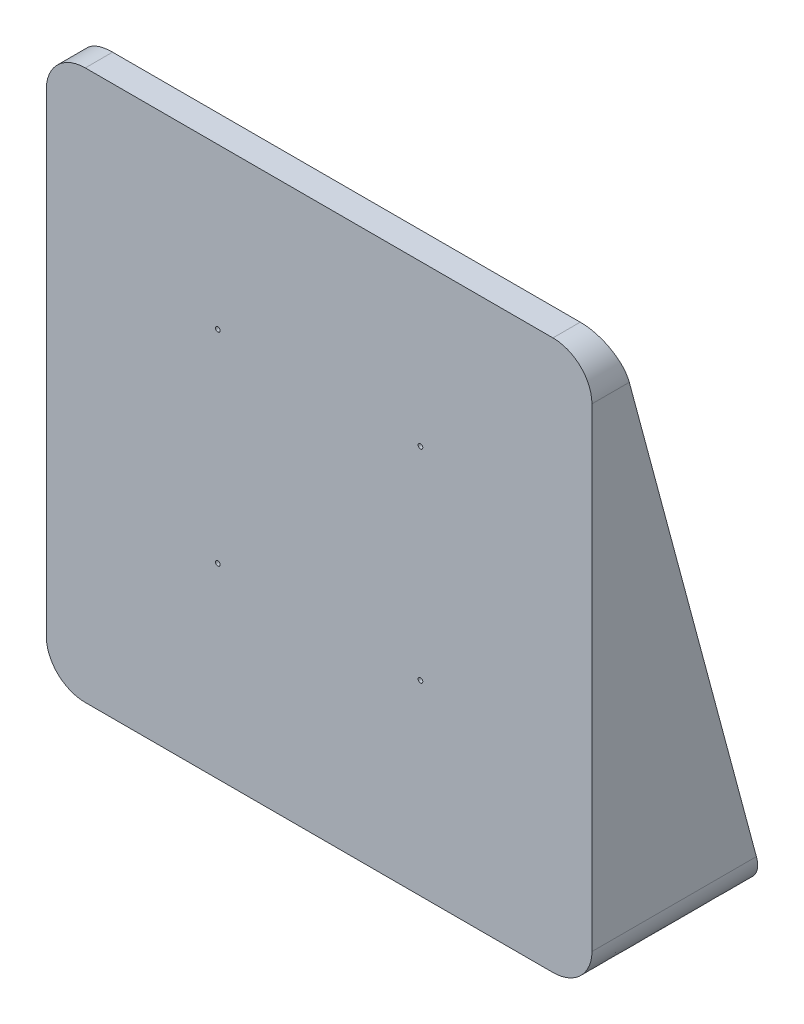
ISO-10303-21;
HEADER;
FILE_DESCRIPTION(('STEP AP214'),'2;1');
FILE_NAME('part.step','',(''),(''),'','','');
FILE_SCHEMA(('AUTOMOTIVE_DESIGN { 1 0 10303 214 1 1 1 1 }'));
ENDSEC;
DATA;
#1=APPLICATION_CONTEXT('core data for automotive mechanical design processes');
#2=APPLICATION_PROTOCOL_DEFINITION('international standard','automotive_design',2000,#1);
#3=PRODUCT_CONTEXT('',#1,'mechanical');
#4=PRODUCT('Part','Part','',(#3));
#5=PRODUCT_RELATED_PRODUCT_CATEGORY('part','',(#4));
#6=PRODUCT_DEFINITION_FORMATION('','',#4);
#7=PRODUCT_DEFINITION_CONTEXT('part definition',#1,'design');
#8=PRODUCT_DEFINITION('design','',#6,#7);
#9=PRODUCT_DEFINITION_SHAPE('','',#8);
#10=(LENGTH_UNIT() NAMED_UNIT(*) SI_UNIT(.MILLI.,.METRE.));
#11=(NAMED_UNIT(*) PLANE_ANGLE_UNIT() SI_UNIT($,.RADIAN.));
#12=(NAMED_UNIT(*) SI_UNIT($,.STERADIAN.) SOLID_ANGLE_UNIT());
#13=UNCERTAINTY_MEASURE_WITH_UNIT(LENGTH_MEASURE(1.E-05),#10,'distance_accuracy_value','');
#14=(GEOMETRIC_REPRESENTATION_CONTEXT(3) GLOBAL_UNCERTAINTY_ASSIGNED_CONTEXT((#13)) GLOBAL_UNIT_ASSIGNED_CONTEXT((#10,
#11,#12)) REPRESENTATION_CONTEXT('',''));
#15=CARTESIAN_POINT('',(0.,0.,0.));
#16=DIRECTION('',(0.,0.,1.));
#17=DIRECTION('',(1.,0.,0.));
#18=AXIS2_PLACEMENT_3D('',#15,#16,#17);
#19=CARTESIAN_POINT('',(300.,-267.903099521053,-1140.57444651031));
#20=CARTESIAN_POINT('',(302.584682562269,-267.903099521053,-1140.57444651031));
#21=CARTESIAN_POINT('',(305.129149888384,-267.665407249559,-1140.57444651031));
#22=CARTESIAN_POINT('',(308.887745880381,-266.965439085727,-1140.57444651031));
#23=CARTESIAN_POINT('',(310.130858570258,-266.674473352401,-1140.57444651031));
#24=CARTESIAN_POINT('',(311.980560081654,-266.149559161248,-1140.57444651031));
#25=CARTESIAN_POINT('',(312.594628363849,-265.959818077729,-1140.57444651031));
#26=CARTESIAN_POINT('',(313.817655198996,-265.550134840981,-1140.57444651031));
#27=CARTESIAN_POINT('',(314.425923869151,-265.330320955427,-1140.57444651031));
#28=CARTESIAN_POINT('',(317.422218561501,-264.167267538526,-1140.57444651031));
#29=CARTESIAN_POINT('',(319.70175715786,-263.025646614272,-1140.57444651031));
#30=CARTESIAN_POINT('',(322.945647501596,-260.997936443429,-1140.57444651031));
#31=CARTESIAN_POINT('',(323.997509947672,-260.269130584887,-1140.57444651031));
#32=CARTESIAN_POINT('',(325.52933047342,-259.093294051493,-1140.57444651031));
#33=CARTESIAN_POINT('',(326.033484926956,-258.686441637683,-1140.57444651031));
#34=CARTESIAN_POINT('',(327.015955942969,-257.853018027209,-1140.57444651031));
#35=CARTESIAN_POINT('',(327.495153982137,-257.425874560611,-1140.57444651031));
#36=CARTESIAN_POINT('',(329.831713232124,-255.238654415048,-1140.57444651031));
#37=CARTESIAN_POINT('',(331.51250205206,-253.325560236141,-1140.57444651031));
#38=CARTESIAN_POINT('',(333.372685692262,-250.725513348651,-1140.57444651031));
#39=CARTESIAN_POINT('',(333.73257324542,-250.19497550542,-1140.57444651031));
#40=CARTESIAN_POINT('',(334.427459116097,-249.112330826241,-1140.57444651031));
#41=CARTESIAN_POINT('',(334.763407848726,-248.558499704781,-1140.57444651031));
#42=CARTESIAN_POINT('',(335.724194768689,-246.878879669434,-1140.57444651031));
#43=CARTESIAN_POINT('',(336.302384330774,-245.735556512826,-1140.57444651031));
#44=CARTESIAN_POINT('',(337.854077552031,-242.236419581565,-1140.57444651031));
#45=CARTESIAN_POINT('',(338.646572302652,-239.812144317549,-1140.57444651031));
#46=CARTESIAN_POINT('',(339.320801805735,-236.662135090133,-1140.57444651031));
#47=CARTESIAN_POINT('',(339.439790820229,-236.024979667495,-1140.57444651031));
#48=CARTESIAN_POINT('',(339.643236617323,-234.7498367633,-1140.57444651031));
#49=CARTESIAN_POINT('',(339.728000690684,-234.110689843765,-1140.57444651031));
#50=CARTESIAN_POINT('',(339.931642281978,-232.188543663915,-1140.57444651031));
#51=CARTESIAN_POINT('',(340.,-230.9008511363,-1140.57444651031));
#52=CARTESIAN_POINT('',(340.,-229.606808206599,-1140.57444651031));
#53=B_SPLINE_CURVE_WITH_KNOTS('',3,(#19,#20,#21,#22,#23,#24,#25,#26,#27,#28,#29,#30,#31,#32,#33,
#34,#35,#36,#37,#38,#39,#40,#41,#42,#43,#44,#45,#46,#47,#48,#49,#50,#51,#52),.UNSPECIFIED.,.F.,
.F.,(4,2,2,2,2,2,2,2,2,2,2,2,2,2,2,2,4),(0.,0.124999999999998,0.187499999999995,
0.218749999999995,0.249999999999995,0.374999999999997,0.437499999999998,0.468749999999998,
0.499999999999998,0.625000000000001,0.656250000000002,0.687500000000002,0.750000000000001,0.875,
0.90625,0.9375,1.),.UNSPECIFIED.);
#54=DIRECTION('',(0.,0.,1.));
#55=VECTOR('',#54,1.);
#56=SURFACE_OF_LINEAR_EXTRUSION('',#53,#55);
#57=CARTESIAN_POINT('',(300.,-267.903099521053,-10.));
#58=CARTESIAN_POINT('',(302.584682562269,-267.903099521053,-10.));
#59=CARTESIAN_POINT('',(305.129149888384,-267.665407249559,-10.));
#60=CARTESIAN_POINT('',(308.887745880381,-266.965439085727,-10.));
#61=CARTESIAN_POINT('',(310.130858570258,-266.674473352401,-10.));
#62=CARTESIAN_POINT('',(311.980560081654,-266.149559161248,-10.));
#63=CARTESIAN_POINT('',(312.594628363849,-265.959818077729,-10.));
#64=CARTESIAN_POINT('',(313.817655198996,-265.550134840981,-10.));
#65=CARTESIAN_POINT('',(314.425923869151,-265.330320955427,-10.));
#66=CARTESIAN_POINT('',(317.422218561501,-264.167267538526,-10.));
#67=CARTESIAN_POINT('',(319.70175715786,-263.025646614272,-10.));
#68=CARTESIAN_POINT('',(322.945647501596,-260.997936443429,-10.));
#69=CARTESIAN_POINT('',(323.997509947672,-260.269130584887,-10.));
#70=CARTESIAN_POINT('',(325.52933047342,-259.093294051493,-10.));
#71=CARTESIAN_POINT('',(326.033484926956,-258.686441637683,-10.));
#72=CARTESIAN_POINT('',(327.015955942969,-257.853018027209,-10.));
#73=CARTESIAN_POINT('',(327.495153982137,-257.425874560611,-10.));
#74=CARTESIAN_POINT('',(329.831713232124,-255.238654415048,-10.));
#75=CARTESIAN_POINT('',(331.51250205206,-253.325560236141,-10.));
#76=CARTESIAN_POINT('',(333.372685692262,-250.725513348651,-10.));
#77=CARTESIAN_POINT('',(333.73257324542,-250.19497550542,-10.));
#78=CARTESIAN_POINT('',(334.427459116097,-249.112330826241,-10.));
#79=CARTESIAN_POINT('',(334.763407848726,-248.558499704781,-10.));
#80=CARTESIAN_POINT('',(335.724194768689,-246.878879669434,-10.));
#81=CARTESIAN_POINT('',(336.302384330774,-245.735556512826,-10.));
#82=CARTESIAN_POINT('',(337.854077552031,-242.236419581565,-10.));
#83=CARTESIAN_POINT('',(338.646572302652,-239.812144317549,-10.));
#84=CARTESIAN_POINT('',(339.320801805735,-236.662135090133,-10.));
#85=CARTESIAN_POINT('',(339.439790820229,-236.024979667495,-10.));
#86=CARTESIAN_POINT('',(339.643236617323,-234.7498367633,-10.));
#87=CARTESIAN_POINT('',(339.728000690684,-234.110689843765,-10.));
#88=CARTESIAN_POINT('',(339.931642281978,-232.188543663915,-10.));
#89=CARTESIAN_POINT('',(340.,-230.9008511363,-10.));
#90=CARTESIAN_POINT('',(340.,-229.606808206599,-10.));
#91=B_SPLINE_CURVE_WITH_KNOTS('',3,(#57,#58,#59,#60,#61,#62,#63,#64,#65,#66,#67,#68,#69,#70,#71,
#72,#73,#74,#75,#76,#77,#78,#79,#80,#81,#82,#83,#84,#85,#86,#87,#88,#89,#90),.UNSPECIFIED.,.F.,
.F.,(4,2,2,2,2,2,2,2,2,2,2,2,2,2,2,2,4),(0.,0.124999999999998,0.187499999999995,
0.218749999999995,0.249999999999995,0.374999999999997,0.437499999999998,0.468749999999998,
0.499999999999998,0.625000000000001,0.656250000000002,0.687500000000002,0.750000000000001,0.875,
0.90625,0.9375,1.),.UNSPECIFIED.);
#92=CARTESIAN_POINT('',(340.,-229.606808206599,-10.));
#93=VERTEX_POINT('',#92);
#94=CARTESIAN_POINT('',(300.,-267.903099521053,-10.));
#95=VERTEX_POINT('',#94);
#96=EDGE_CURVE('E166',#93,#95,#91,.F.);
#97=ORIENTED_EDGE('',*,*,#96,.F.);
#98=DIRECTION('',(0.,0.,1.));
#99=VECTOR('',#98,1.);
#100=CARTESIAN_POINT('',(340.,-229.606808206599,-1140.57444651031));
#101=LINE('',#100,#99);
#102=CARTESIAN_POINT('',(340.,-229.606808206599,-210.996950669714));
#103=VERTEX_POINT('',#102);
#104=EDGE_CURVE('E157',#103,#93,#101,.T.);
#105=ORIENTED_EDGE('',*,*,#104,.F.);
#106=CARTESIAN_POINT('',(300.,-267.903099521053,-221.258411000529));
#107=CARTESIAN_POINT('',(300.377555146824,-267.903103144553,-221.258411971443));
#108=CARTESIAN_POINT('',(300.755091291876,-267.898027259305,-221.25705189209));
#109=CARTESIAN_POINT('',(301.509870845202,-267.877666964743,-221.251596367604));
#110=CARTESIAN_POINT('',(301.887114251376,-267.862382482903,-221.247500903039));
#111=CARTESIAN_POINT('',(303.01789841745,-267.801148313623,-221.231093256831));
#112=CARTESIAN_POINT('',(303.770610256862,-267.739817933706,-221.21465983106));
#113=CARTESIAN_POINT('',(305.271191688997,-267.576211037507,-221.170821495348));
#114=CARTESIAN_POINT('',(306.019061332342,-267.473934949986,-221.143416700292));
#115=CARTESIAN_POINT('',(307.507339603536,-267.229243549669,-221.077851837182));
#116=CARTESIAN_POINT('',(308.247751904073,-267.086849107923,-221.039697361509));
#117=CARTESIAN_POINT('',(309.719111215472,-266.762076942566,-220.952674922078));
#118=CARTESIAN_POINT('',(310.450058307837,-266.579699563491,-220.903807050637));
#119=CARTESIAN_POINT('',(311.900200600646,-266.175588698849,-220.795525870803));
#120=CARTESIAN_POINT('',(312.619395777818,-265.953855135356,-220.736112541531));
#121=CARTESIAN_POINT('',(314.044120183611,-265.471489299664,-220.606863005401));
#122=CARTESIAN_POINT('',(314.749641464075,-265.21083512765,-220.537020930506));
#123=CARTESIAN_POINT('',(316.144462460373,-264.651743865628,-220.387212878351));
#124=CARTESIAN_POINT('',(316.83376200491,-264.353306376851,-220.307246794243));
#125=CARTESIAN_POINT('',(318.193766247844,-263.719213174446,-220.137342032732));
#126=CARTESIAN_POINT('',(318.864471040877,-263.383557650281,-220.047403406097));
#127=CARTESIAN_POINT('',(320.184935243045,-262.676144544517,-219.857852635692));
#128=CARTESIAN_POINT('',(320.834699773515,-262.3043958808,-219.758242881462));
#129=CARTESIAN_POINT('',(322.111574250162,-261.526227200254,-219.549733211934));
#130=CARTESIAN_POINT('',(322.738683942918,-261.119806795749,-219.44083319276));
#131=CARTESIAN_POINT('',(323.968093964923,-260.273244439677,-219.213997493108));
#132=CARTESIAN_POINT('',(324.570394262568,-259.833102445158,-219.096061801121));
#133=CARTESIAN_POINT('',(325.37913749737,-259.206503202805,-218.928165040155));
#134=CARTESIAN_POINT('',(325.59717918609,-259.033870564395,-218.881908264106));
#135=CARTESIAN_POINT('',(326.029442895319,-258.684204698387,-218.788215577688));
#136=CARTESIAN_POINT('',(326.24366498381,-258.507171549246,-218.740779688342));
#137=CARTESIAN_POINT('',(326.880422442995,-257.969534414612,-218.596720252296));
#138=CARTESIAN_POINT('',(327.297072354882,-257.602374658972,-218.498340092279));
#139=CARTESIAN_POINT('',(327.909613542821,-257.039151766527,-218.34742497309));
#140=CARTESIAN_POINT('',(328.111713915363,-256.849338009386,-218.296564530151));
#141=CARTESIAN_POINT('',(328.511730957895,-256.465643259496,-218.193753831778));
#142=CARTESIAN_POINT('',(328.709647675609,-256.271762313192,-218.141803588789));
#143=CARTESIAN_POINT('',(329.297044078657,-255.683996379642,-217.984312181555));
#144=CARTESIAN_POINT('',(329.680082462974,-255.284068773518,-217.877151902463));
#145=CARTESIAN_POINT('',(330.428132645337,-254.468763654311,-217.658691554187));
#146=CARTESIAN_POINT('',(330.793143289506,-254.053385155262,-217.547391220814));
#147=CARTESIAN_POINT('',(331.504497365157,-253.207854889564,-217.320832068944));
#148=CARTESIAN_POINT('',(331.850838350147,-252.777701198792,-217.20557273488));
#149=CARTESIAN_POINT('',(332.3558412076,-252.122130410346,-217.029913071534));
#150=CARTESIAN_POINT('',(332.521752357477,-251.901890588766,-216.970899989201));
#151=CARTESIAN_POINT('',(332.848712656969,-251.458069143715,-216.851978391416));
#152=CARTESIAN_POINT('',(333.009761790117,-251.234487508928,-216.792069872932));
#153=CARTESIAN_POINT('',(333.485403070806,-250.558910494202,-216.611049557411));
#154=CARTESIAN_POINT('',(333.792559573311,-250.101991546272,-216.488618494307));
#155=CARTESIAN_POINT('',(334.28584912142,-249.332634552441,-216.282469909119));
#156=CARTESIAN_POINT('',(334.477760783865,-249.023631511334,-216.199672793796));
#157=CARTESIAN_POINT('',(334.852442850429,-248.400594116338,-216.032730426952));
#158=CARTESIAN_POINT('',(335.035215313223,-248.086560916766,-215.94858548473));
#159=CARTESIAN_POINT('',(335.569654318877,-247.137084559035,-215.694174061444));
#160=CARTESIAN_POINT('',(335.907433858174,-246.494278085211,-215.521934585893));
#161=CARTESIAN_POINT('',(336.544708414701,-245.191197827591,-215.172775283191));
#162=CARTESIAN_POINT('',(336.844200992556,-244.530922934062,-214.995855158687));
#163=CARTESIAN_POINT('',(337.404005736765,-243.195507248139,-214.638031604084));
#164=CARTESIAN_POINT('',(337.664341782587,-242.52037580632,-214.457130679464));
#165=CARTESIAN_POINT('',(338.144690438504,-241.15692081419,-214.091794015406));
#166=CARTESIAN_POINT('',(338.364706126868,-240.468598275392,-213.907358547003));
#167=CARTESIAN_POINT('',(338.763705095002,-239.08111972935,-213.535584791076));
#168=CARTESIAN_POINT('',(338.942699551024,-238.381966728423,-213.348247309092));
#169=CARTESIAN_POINT('',(339.20061815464,-237.236591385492,-213.041344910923));
#170=CARTESIAN_POINT('',(339.292008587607,-236.792948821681,-212.922471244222));
#171=CARTESIAN_POINT('',(339.458324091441,-235.902870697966,-212.683975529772));
#172=CARTESIAN_POINT('',(339.53325246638,-235.456435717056,-212.564353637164));
#173=CARTESIAN_POINT('',(339.666524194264,-234.561311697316,-212.324505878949));
#174=CARTESIAN_POINT('',(339.724869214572,-234.112622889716,-212.204280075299));
#175=CARTESIAN_POINT('',(339.824873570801,-233.214160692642,-211.963537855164));
#176=CARTESIAN_POINT('',(339.866556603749,-232.764389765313,-211.843022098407));
#177=CARTESIAN_POINT('',(339.93327057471,-231.863651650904,-211.601670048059));
#178=CARTESIAN_POINT('',(339.958299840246,-231.41268434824,-211.480833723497));
#179=CARTESIAN_POINT('',(339.991675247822,-230.510080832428,-211.23898184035));
#180=CARTESIAN_POINT('',(340.000017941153,-230.058444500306,-211.117966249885));
#181=CARTESIAN_POINT('',(340.,-229.606808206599,-210.996950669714));
#182=B_SPLINE_CURVE_WITH_KNOTS('',3,(#106,#107,#108,#109,#110,#111,#112,#113,#114,#115,#116,
#117,#118,#119,#120,#121,#122,#123,#124,#125,#126,#127,#128,#129,#130,#131,#132,#133,#134,#135,
#136,#137,#138,#139,#140,#141,#142,#143,#144,#145,#146,#147,#148,#149,#150,#151,#152,#153,#154,
#155,#156,#157,#158,#159,#160,#161,#162,#163,#164,#165,#166,#167,#168,#169,#170,#171,#172,#173,
#174,#175,#176,#177,#178,#179,#180,#181),.UNSPECIFIED.,.F.,.F.,(4,2,2,2,2,2,2,2,2,2,2,2,2,2,2,2,
2,2,2,2,2,2,2,2,2,2,2,2,2,2,2,2,2,2,2,2,2,4),(0.,1.13258980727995,2.26518766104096,
4.53003247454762,6.79485357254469,9.05849859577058,11.3221241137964,13.5857541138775,
15.850662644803,18.1155950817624,20.3805159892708,22.6448786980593,24.9092667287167,
27.1736576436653,28.0193971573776,28.8651216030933,30.556480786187,31.4020935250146,
32.2476966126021,33.9392650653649,35.6309416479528,37.3228393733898,38.168734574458,
39.014632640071,40.7060749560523,41.8250975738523,42.9438669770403,45.1814548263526,
47.4191851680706,49.6555452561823,51.8917345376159,54.1273138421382,55.5319408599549,
56.9362856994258,58.3404892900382,59.7426886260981,61.1450287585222,62.547658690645),.UNSPECIFIED.);
#183=CARTESIAN_POINT('',(300.,-267.903099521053,-221.258411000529));
#184=VERTEX_POINT('',#183);
#185=EDGE_CURVE('E264',#184,#103,#182,.T.);
#186=ORIENTED_EDGE('',*,*,#185,.F.);
#187=DIRECTION('',(0.,0.,1.));
#188=VECTOR('',#187,1.);
#189=CARTESIAN_POINT('',(300.,-267.903099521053,-1140.57444651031));
#190=LINE('',#189,#188);
#191=EDGE_CURVE('E169',#184,#95,#190,.T.);
#192=ORIENTED_EDGE('',*,*,#191,.T.);
#193=EDGE_LOOP('',(#97,#105,#186,#192));
#194=FACE_BOUND('',#193,.T.);
#195=ADVANCED_FACE('F37',(#194),#56,.F.);
#196=CARTESIAN_POINT('',(-300.,-267.903099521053,-1140.57444651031));
#197=DIRECTION('',(0.,-1.,0.));
#198=DIRECTION('',(0.,0.,-1.));
#199=AXIS2_PLACEMENT_3D('',#196,#197,#198);
#200=PLANE('',#199);
#201=DIRECTION('',(-1.,0.,0.));
#202=VECTOR('',#201,1.);
#203=CARTESIAN_POINT('',(-300.,-267.903099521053,-10.));
#204=LINE('',#203,#202);
#205=CARTESIAN_POINT('',(-300.,-267.903099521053,-10.));
#206=VERTEX_POINT('',#205);
#207=EDGE_CURVE('E56',#95,#206,#204,.T.);
#208=ORIENTED_EDGE('',*,*,#207,.F.);
#209=ORIENTED_EDGE('',*,*,#191,.F.);
#210=DIRECTION('',(1.,0.,0.));
#211=VECTOR('',#210,1.);
#212=CARTESIAN_POINT('',(-300.,-267.903099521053,-221.258411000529));
#213=LINE('',#212,#211);
#214=CARTESIAN_POINT('',(-300.,-267.903099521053,-221.258411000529));
#215=VERTEX_POINT('',#214);
#216=EDGE_CURVE('E462',#215,#184,#213,.T.);
#217=ORIENTED_EDGE('',*,*,#216,.F.);
#218=DIRECTION('',(0.,0.,1.));
#219=VECTOR('',#218,1.);
#220=CARTESIAN_POINT('',(-300.,-267.903099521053,-1140.57444651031));
#221=LINE('',#220,#219);
#222=EDGE_CURVE('E433',#215,#206,#221,.T.);
#223=ORIENTED_EDGE('',*,*,#222,.T.);
#224=EDGE_LOOP('',(#208,#209,#217,#223));
#225=FACE_BOUND('',#224,.T.);
#226=ADVANCED_FACE('F240',(#225),#200,.F.);
#227=CARTESIAN_POINT('',(-340.,-229.6068082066,-1140.57444651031));
#228=CARTESIAN_POINT('',(-340.,-232.192651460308,-1140.57444651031));
#229=CARTESIAN_POINT('',(-339.729152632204,-234.731972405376,-1140.57444651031));
#230=CARTESIAN_POINT('',(-338.935209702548,-238.47436506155,-1140.57444651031));
#231=CARTESIAN_POINT('',(-338.605445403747,-239.710644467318,-1140.57444651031));
#232=CARTESIAN_POINT('',(-338.01097149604,-241.547916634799,-1140.57444651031));
#233=CARTESIAN_POINT('',(-337.795551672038,-242.158827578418,-1140.57444651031));
#234=CARTESIAN_POINT('',(-337.335947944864,-243.361647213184,-1140.57444651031));
#235=CARTESIAN_POINT('',(-337.091409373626,-243.954898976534,-1140.57444651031));
#236=CARTESIAN_POINT('',(-335.796673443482,-246.881275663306,-1140.57444651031));
#237=CARTESIAN_POINT('',(-334.532449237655,-249.095918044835,-1140.57444651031));
#238=CARTESIAN_POINT('',(-332.298527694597,-252.230998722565,-1140.57444651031));
#239=CARTESIAN_POINT('',(-331.493212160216,-253.248422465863,-1140.57444651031));
#240=CARTESIAN_POINT('',(-329.801836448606,-255.179246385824,-1140.57444651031));
#241=CARTESIAN_POINT('',(-328.913094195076,-256.097317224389,-1140.57444651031));
#242=CARTESIAN_POINT('',(-327.052195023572,-257.841739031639,-1140.57444651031));
#243=CARTESIAN_POINT('',(-326.080031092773,-258.668082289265,-1140.57444651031));
#244=CARTESIAN_POINT('',(-324.559388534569,-259.838987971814,-1140.57444651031));
#245=CARTESIAN_POINT('',(-324.042089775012,-260.217834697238,-1140.57444651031));
#246=CARTESIAN_POINT('',(-322.986460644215,-260.95240251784,-1140.57444651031));
#247=CARTESIAN_POINT('',(-322.446688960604,-261.308988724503,-1140.57444651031));
#248=CARTESIAN_POINT('',(-319.717395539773,-263.019094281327,-1140.57444651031));
#249=CARTESIAN_POINT('',(-317.43424052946,-264.160372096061,-1140.57444651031));
#250=CARTESIAN_POINT('',(-313.867076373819,-265.548338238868,-1140.57444651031));
#251=CARTESIAN_POINT('',(-312.654108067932,-265.956603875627,-1140.57444651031));
#252=CARTESIAN_POINT('',(-310.798143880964,-266.485959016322,-1140.57444651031));
#253=CARTESIAN_POINT('',(-310.172182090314,-266.648785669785,-1140.57444651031));
#254=CARTESIAN_POINT('',(-308.918216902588,-266.943898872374,-1140.57444651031));
#255=CARTESIAN_POINT('',(-308.28933551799,-267.076496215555,-1140.57444651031));
#256=CARTESIAN_POINT('',(-305.135565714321,-267.665719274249,-1140.57444651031));
#257=CARTESIAN_POINT('',(-302.582848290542,-267.903099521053,-1140.57444651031));
#258=CARTESIAN_POINT('',(-300.,-267.903099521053,-1140.57444651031));
#259=B_SPLINE_CURVE_WITH_KNOTS('',3,(#227,#228,#229,#230,#231,#232,#233,#234,#235,#236,#237,
#238,#239,#240,#241,#242,#243,#244,#245,#246,#247,#248,#249,#250,#251,#252,#253,#254,#255,#256,
#257,#258),.UNSPECIFIED.,.F.,.F.,(4,2,2,2,2,2,2,2,2,2,2,2,2,2,2,4),(0.,0.124999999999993,
0.18749999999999,0.218749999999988,0.249999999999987,0.374999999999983,0.437499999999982,
0.49999999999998,0.562499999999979,0.593749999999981,0.624999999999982,0.749999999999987,
0.812499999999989,0.84374999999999,0.874999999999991,1.),.UNSPECIFIED.);
#260=DIRECTION('',(0.,0.,1.));
#261=VECTOR('',#260,1.);
#262=SURFACE_OF_LINEAR_EXTRUSION('',#259,#261);
#263=CARTESIAN_POINT('',(-340.,-229.6068082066,-10.));
#264=CARTESIAN_POINT('',(-340.,-232.192651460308,-10.));
#265=CARTESIAN_POINT('',(-339.729152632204,-234.731972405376,-10.));
#266=CARTESIAN_POINT('',(-338.935209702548,-238.47436506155,-10.));
#267=CARTESIAN_POINT('',(-338.605445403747,-239.710644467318,-10.));
#268=CARTESIAN_POINT('',(-338.01097149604,-241.547916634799,-10.));
#269=CARTESIAN_POINT('',(-337.795551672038,-242.158827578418,-10.));
#270=CARTESIAN_POINT('',(-337.335947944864,-243.361647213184,-10.));
#271=CARTESIAN_POINT('',(-337.091409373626,-243.954898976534,-10.));
#272=CARTESIAN_POINT('',(-335.796673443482,-246.881275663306,-10.));
#273=CARTESIAN_POINT('',(-334.532449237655,-249.095918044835,-10.));
#274=CARTESIAN_POINT('',(-332.298527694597,-252.230998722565,-10.));
#275=CARTESIAN_POINT('',(-331.493212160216,-253.248422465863,-10.));
#276=CARTESIAN_POINT('',(-329.801836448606,-255.179246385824,-10.));
#277=CARTESIAN_POINT('',(-328.913094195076,-256.097317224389,-10.));
#278=CARTESIAN_POINT('',(-327.052195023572,-257.841739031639,-10.));
#279=CARTESIAN_POINT('',(-326.080031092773,-258.668082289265,-10.));
#280=CARTESIAN_POINT('',(-324.559388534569,-259.838987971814,-10.));
#281=CARTESIAN_POINT('',(-324.042089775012,-260.217834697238,-10.));
#282=CARTESIAN_POINT('',(-322.986460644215,-260.95240251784,-10.));
#283=CARTESIAN_POINT('',(-322.446688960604,-261.308988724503,-10.));
#284=CARTESIAN_POINT('',(-319.717395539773,-263.019094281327,-10.));
#285=CARTESIAN_POINT('',(-317.43424052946,-264.160372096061,-10.));
#286=CARTESIAN_POINT('',(-313.867076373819,-265.548338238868,-10.));
#287=CARTESIAN_POINT('',(-312.654108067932,-265.956603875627,-10.));
#288=CARTESIAN_POINT('',(-310.798143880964,-266.485959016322,-10.));
#289=CARTESIAN_POINT('',(-310.172182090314,-266.648785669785,-10.));
#290=CARTESIAN_POINT('',(-308.918216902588,-266.943898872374,-10.));
#291=CARTESIAN_POINT('',(-308.28933551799,-267.076496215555,-10.));
#292=CARTESIAN_POINT('',(-305.135565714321,-267.665719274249,-10.));
#293=CARTESIAN_POINT('',(-302.582848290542,-267.903099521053,-10.));
#294=CARTESIAN_POINT('',(-300.,-267.903099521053,-10.));
#295=B_SPLINE_CURVE_WITH_KNOTS('',3,(#263,#264,#265,#266,#267,#268,#269,#270,#271,#272,#273,
#274,#275,#276,#277,#278,#279,#280,#281,#282,#283,#284,#285,#286,#287,#288,#289,#290,#291,#292,
#293,#294),.UNSPECIFIED.,.F.,.F.,(4,2,2,2,2,2,2,2,2,2,2,2,2,2,2,4),(0.,0.124999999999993,
0.18749999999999,0.218749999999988,0.249999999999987,0.374999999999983,0.437499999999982,
0.49999999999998,0.562499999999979,0.593749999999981,0.624999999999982,0.749999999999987,
0.812499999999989,0.84374999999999,0.874999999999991,1.),.UNSPECIFIED.);
#296=CARTESIAN_POINT('',(-340.,-229.6068082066,-10.));
#297=VERTEX_POINT('',#296);
#298=EDGE_CURVE('E64',#206,#297,#295,.F.);
#299=ORIENTED_EDGE('',*,*,#298,.F.);
#300=ORIENTED_EDGE('',*,*,#222,.F.);
#301=CARTESIAN_POINT('',(-340.,-229.6068082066,-210.996950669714));
#302=CARTESIAN_POINT('',(-340.000003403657,-229.9634553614,-211.092513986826));
#303=CARTESIAN_POINT('',(-339.994847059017,-230.320086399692,-211.188072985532));
#304=CARTESIAN_POINT('',(-339.974160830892,-231.033070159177,-211.379116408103));
#305=CARTESIAN_POINT('',(-339.958630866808,-231.389422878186,-211.474600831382));
#306=CARTESIAN_POINT('',(-339.896407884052,-232.457543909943,-211.76080299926));
#307=CARTESIAN_POINT('',(-339.834081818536,-233.168517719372,-211.951307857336));
#308=CARTESIAN_POINT('',(-339.667811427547,-234.585889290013,-212.331091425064));
#309=CARTESIAN_POINT('',(-339.563868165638,-235.292287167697,-212.520370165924));
#310=CARTESIAN_POINT('',(-339.377319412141,-236.346376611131,-212.802812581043));
#311=CARTESIAN_POINT('',(-339.310069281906,-236.696660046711,-212.896670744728));
#312=CARTESIAN_POINT('',(-339.165475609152,-237.395277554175,-213.083864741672));
#313=CARTESIAN_POINT('',(-339.088132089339,-237.743611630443,-213.177200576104));
#314=CARTESIAN_POINT('',(-338.840911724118,-238.785235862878,-213.456302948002));
#315=CARTESIAN_POINT('',(-338.655833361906,-239.475214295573,-213.641182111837));
#316=CARTESIAN_POINT('',(-338.245820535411,-240.844034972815,-214.007956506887));
#317=CARTESIAN_POINT('',(-338.020885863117,-241.522877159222,-214.189851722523));
#318=CARTESIAN_POINT('',(-337.654199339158,-242.531270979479,-214.460050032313));
#319=CARTESIAN_POINT('',(-337.527055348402,-242.865837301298,-214.549696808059));
#320=CARTESIAN_POINT('',(-337.263076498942,-243.531393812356,-214.728032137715));
#321=CARTESIAN_POINT('',(-337.12624163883,-243.862384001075,-214.816720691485));
#322=CARTESIAN_POINT('',(-336.843023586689,-244.520532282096,-214.993070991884));
#323=CARTESIAN_POINT('',(-336.696640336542,-244.847690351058,-215.08073273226));
#324=CARTESIAN_POINT('',(-336.394504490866,-245.497935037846,-215.254965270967));
#325=CARTESIAN_POINT('',(-336.238751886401,-245.821021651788,-215.341536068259));
#326=CARTESIAN_POINT('',(-335.757513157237,-246.783734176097,-215.59949411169));
#327=CARTESIAN_POINT('',(-335.418014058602,-247.416887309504,-215.769146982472));
#328=CARTESIAN_POINT('',(-334.702705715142,-248.663671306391,-216.103221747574));
#329=CARTESIAN_POINT('',(-334.326900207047,-249.277304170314,-216.267644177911));
#330=CARTESIAN_POINT('',(-333.737050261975,-250.181760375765,-216.509992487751));
#331=CARTESIAN_POINT('',(-333.536064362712,-250.480596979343,-216.590065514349));
#332=CARTESIAN_POINT('',(-333.125585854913,-251.072776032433,-216.748739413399));
#333=CARTESIAN_POINT('',(-332.916093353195,-251.366118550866,-216.827340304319));
#334=CARTESIAN_POINT('',(-332.488669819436,-251.947001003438,-216.982987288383));
#335=CARTESIAN_POINT('',(-332.270738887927,-252.234541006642,-217.060033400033));
#336=CARTESIAN_POINT('',(-331.826722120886,-252.803706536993,-217.21254084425));
#337=CARTESIAN_POINT('',(-331.600635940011,-253.085331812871,-217.28800210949));
#338=CARTESIAN_POINT('',(-331.197200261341,-253.573725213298,-217.418866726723));
#339=CARTESIAN_POINT('',(-331.021579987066,-253.7818280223,-217.474627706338));
#340=CARTESIAN_POINT('',(-330.665820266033,-254.19439928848,-217.585175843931));
#341=CARTESIAN_POINT('',(-330.485680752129,-254.398867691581,-217.639962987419));
#342=CARTESIAN_POINT('',(-329.938657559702,-255.006756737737,-217.802846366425));
#343=CARTESIAN_POINT('',(-329.56516829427,-255.404662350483,-217.909464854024));
#344=CARTESIAN_POINT('',(-328.801242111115,-256.184964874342,-218.118546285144));
#345=CARTESIAN_POINT('',(-328.410805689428,-256.56736223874,-218.221009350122));
#346=CARTESIAN_POINT('',(-327.61378771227,-257.316044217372,-218.421618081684));
#347=CARTESIAN_POINT('',(-327.207206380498,-257.682329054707,-218.519763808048));
#348=CARTESIAN_POINT('',(-325.963973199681,-258.756216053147,-218.807510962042));
#349=CARTESIAN_POINT('',(-325.103825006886,-259.438858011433,-218.990424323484));
#350=CARTESIAN_POINT('',(-323.772060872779,-260.40885399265,-219.250333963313));
#351=CARTESIAN_POINT('',(-323.321165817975,-260.723221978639,-219.334568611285));
#352=CARTESIAN_POINT('',(-322.406165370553,-261.333571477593,-219.49811126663));
#353=CARTESIAN_POINT('',(-321.942059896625,-261.629552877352,-219.577419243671));
#354=CARTESIAN_POINT('',(-320.997661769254,-262.205074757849,-219.731629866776));
#355=CARTESIAN_POINT('',(-320.517266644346,-262.484458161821,-219.806490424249));
#356=CARTESIAN_POINT('',(-319.544687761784,-263.023500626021,-219.950926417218));
#357=CARTESIAN_POINT('',(-319.05250281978,-263.28315769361,-220.020501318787));
#358=CARTESIAN_POINT('',(-318.057219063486,-263.782228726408,-220.154226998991));
#359=CARTESIAN_POINT('',(-317.554119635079,-264.021641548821,-220.218377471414));
#360=CARTESIAN_POINT('',(-316.538014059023,-264.479829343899,-220.341148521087));
#361=CARTESIAN_POINT('',(-316.025008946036,-264.698606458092,-220.399769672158));
#362=CARTESIAN_POINT('',(-314.990216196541,-265.115306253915,-220.511424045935));
#363=CARTESIAN_POINT('',(-314.468431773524,-265.313236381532,-220.564459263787));
#364=CARTESIAN_POINT('',(-313.416731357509,-265.687834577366,-220.664832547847));
#365=CARTESIAN_POINT('',(-312.886815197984,-265.864502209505,-220.712170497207));
#366=CARTESIAN_POINT('',(-311.819897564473,-266.196264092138,-220.801065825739));
#367=CARTESIAN_POINT('',(-311.282897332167,-266.351362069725,-220.842624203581));
#368=CARTESIAN_POINT('',(-310.202722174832,-266.639799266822,-220.91991071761));
#369=CARTESIAN_POINT('',(-309.659547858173,-266.773140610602,-220.955639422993));
#370=CARTESIAN_POINT('',(-308.615786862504,-267.007050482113,-221.018315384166));
#371=CARTESIAN_POINT('',(-308.115643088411,-267.109467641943,-221.045757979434));
#372=CARTESIAN_POINT('',(-307.111788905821,-267.295928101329,-221.095719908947));
#373=CARTESIAN_POINT('',(-306.608079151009,-267.37997468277,-221.118240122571));
#374=CARTESIAN_POINT('',(-305.597764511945,-267.529517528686,-221.158310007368));
#375=CARTESIAN_POINT('',(-305.091159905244,-267.595015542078,-221.175860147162));
#376=CARTESIAN_POINT('',(-304.076447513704,-267.707199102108,-221.205919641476));
#377=CARTESIAN_POINT('',(-303.568342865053,-267.753911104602,-221.218436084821));
#378=CARTESIAN_POINT('',(-302.55061283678,-267.828594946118,-221.238447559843));
#379=CARTESIAN_POINT('',(-302.04098731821,-267.856565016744,-221.245942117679));
#380=CARTESIAN_POINT('',(-301.020906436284,-267.893828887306,-221.255926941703));
#381=CARTESIAN_POINT('',(-300.510450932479,-267.90311910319,-221.258416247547));
#382=CARTESIAN_POINT('',(-300.,-267.903099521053,-221.258411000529));
#383=B_SPLINE_CURVE_WITH_KNOTS('',3,(#301,#302,#303,#304,#305,#306,#307,#308,#309,#310,#311,
#312,#313,#314,#315,#316,#317,#318,#319,#320,#321,#322,#323,#324,#325,#326,#327,#328,#329,#330,
#331,#332,#333,#334,#335,#336,#337,#338,#339,#340,#341,#342,#343,#344,#345,#346,#347,#348,#349,
#350,#351,#352,#353,#354,#355,#356,#357,#358,#359,#360,#361,#362,#363,#364,#365,#366,#367,#368,
#369,#370,#371,#372,#373,#374,#375,#376,#377,#378,#379,#380,#381,#382),.UNSPECIFIED.,.F.,.F.,(4,
2,2,2,2,2,2,2,2,2,2,2,2,2,2,2,2,2,2,2,2,2,2,2,2,2,2,2,2,2,2,2,2,2,2,2,2,2,2,2,4),(0.,
1.10761444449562,2.21523749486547,4.43004128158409,6.64478847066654,7.75113228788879,
8.85747361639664,11.0699477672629,13.2824334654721,14.3892133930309,15.4959934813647,
16.6027803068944,17.7095681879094,19.9228936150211,22.1359914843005,23.2426676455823,
24.3493299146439,25.4559790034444,26.5626750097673,27.3964767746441,28.2302909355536,
29.8979147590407,31.565489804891,33.2330417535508,36.5681144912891,38.2360047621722,
39.9039053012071,41.585667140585,43.2675986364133,44.9496250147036,46.6314766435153,
48.3127255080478,49.9940088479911,51.6750013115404,53.3558295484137,54.8892450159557,
56.4223863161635,57.9553830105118,59.4862132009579,61.017187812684,62.5484561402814),.UNSPECIFIED.);
#384=CARTESIAN_POINT('',(-340.,-229.6068082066,-210.996950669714));
#385=VERTEX_POINT('',#384);
#386=EDGE_CURVE('E256',#385,#215,#383,.T.);
#387=ORIENTED_EDGE('',*,*,#386,.F.);
#388=DIRECTION('',(0.,0.,1.));
#389=VECTOR('',#388,1.);
#390=CARTESIAN_POINT('',(-340.,-229.6068082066,-1140.57444651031));
#391=LINE('',#390,#389);
#392=EDGE_CURVE('E431',#385,#297,#391,.T.);
#393=ORIENTED_EDGE('',*,*,#392,.T.);
#394=EDGE_LOOP('',(#299,#300,#387,#393));
#395=FACE_BOUND('',#394,.T.);
#396=ADVANCED_FACE('F380',(#395),#262,.F.);
#397=CARTESIAN_POINT('',(-340.,378.926462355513,-1140.57444651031));
#398=DIRECTION('',(-1.,0.,0.));
#399=DIRECTION('',(0.,-1.,0.));
#400=AXIS2_PLACEMENT_3D('',#397,#398,#399);
#401=PLANE('',#400);
#402=DIRECTION('',(0.,1.,0.));
#403=VECTOR('',#402,1.);
#404=CARTESIAN_POINT('',(-340.,378.926462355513,-10.));
#405=LINE('',#404,#403);
#406=CARTESIAN_POINT('',(-340.,378.926462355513,-10.));
#407=VERTEX_POINT('',#406);
#408=EDGE_CURVE('E198',#297,#407,#405,.T.);
#409=ORIENTED_EDGE('',*,*,#408,.F.);
#410=ORIENTED_EDGE('',*,*,#392,.F.);
#411=DIRECTION('',(0.,-0.965925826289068,-0.258819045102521));
#412=VECTOR('',#411,1.);
#413=CARTESIAN_POINT('',(-340.,105.768088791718,-121.133517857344));
#414=LINE('',#413,#412);
#415=CARTESIAN_POINT('',(-340.,378.926462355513,-47.940952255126));
#416=VERTEX_POINT('',#415);
#417=EDGE_CURVE('E465',#416,#385,#414,.T.);
#418=ORIENTED_EDGE('',*,*,#417,.F.);
#419=DIRECTION('',(0.,0.,1.));
#420=VECTOR('',#419,1.);
#421=CARTESIAN_POINT('',(-340.,378.926462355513,-1140.57444651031));
#422=LINE('',#421,#420);
#423=EDGE_CURVE('E426',#416,#407,#422,.T.);
#424=ORIENTED_EDGE('',*,*,#423,.T.);
#425=EDGE_LOOP('',(#409,#410,#418,#424));
#426=FACE_BOUND('',#425,.T.);
#427=ADVANCED_FACE('F411',(#426),#401,.F.);
#428=CARTESIAN_POINT('',(-300.,417.222753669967,-1140.57444651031));
#429=CARTESIAN_POINT('',(-302.584682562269,417.222753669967,-1140.57444651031));
#430=CARTESIAN_POINT('',(-305.129149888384,416.985061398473,-1140.57444651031));
#431=CARTESIAN_POINT('',(-308.887745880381,416.28509323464,-1140.57444651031));
#432=CARTESIAN_POINT('',(-310.130858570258,415.994127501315,-1140.57444651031));
#433=CARTESIAN_POINT('',(-311.980560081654,415.469213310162,-1140.57444651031));
#434=CARTESIAN_POINT('',(-312.594628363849,415.279472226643,-1140.57444651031));
#435=CARTESIAN_POINT('',(-313.817655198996,414.869788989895,-1140.57444651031));
#436=CARTESIAN_POINT('',(-314.425923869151,414.649975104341,-1140.57444651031));
#437=CARTESIAN_POINT('',(-317.422218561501,413.486921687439,-1140.57444651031));
#438=CARTESIAN_POINT('',(-319.70175715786,412.345300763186,-1140.57444651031));
#439=CARTESIAN_POINT('',(-322.945647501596,410.317590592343,-1140.57444651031));
#440=CARTESIAN_POINT('',(-323.997509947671,409.588784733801,-1140.57444651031));
#441=CARTESIAN_POINT('',(-325.52933047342,408.412948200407,-1140.57444651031));
#442=CARTESIAN_POINT('',(-326.033484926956,408.006095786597,-1140.57444651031));
#443=CARTESIAN_POINT('',(-327.015955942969,407.172672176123,-1140.57444651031));
#444=CARTESIAN_POINT('',(-327.495153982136,406.745528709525,-1140.57444651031));
#445=CARTESIAN_POINT('',(-329.831713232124,404.558308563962,-1140.57444651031));
#446=CARTESIAN_POINT('',(-331.51250205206,402.645214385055,-1140.57444651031));
#447=CARTESIAN_POINT('',(-333.372685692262,400.045167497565,-1140.57444651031));
#448=CARTESIAN_POINT('',(-333.73257324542,399.514629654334,-1140.57444651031));
#449=CARTESIAN_POINT('',(-334.427459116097,398.431984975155,-1140.57444651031));
#450=CARTESIAN_POINT('',(-334.763407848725,397.878153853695,-1140.57444651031));
#451=CARTESIAN_POINT('',(-335.724194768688,396.198533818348,-1140.57444651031));
#452=CARTESIAN_POINT('',(-336.302384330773,395.05521066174,-1140.57444651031));
#453=CARTESIAN_POINT('',(-337.85407755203,391.556073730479,-1140.57444651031));
#454=CARTESIAN_POINT('',(-338.646572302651,389.131798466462,-1140.57444651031));
#455=CARTESIAN_POINT('',(-339.320801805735,385.981789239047,-1140.57444651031));
#456=CARTESIAN_POINT('',(-339.439790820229,385.344633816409,-1140.57444651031));
#457=CARTESIAN_POINT('',(-339.643236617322,384.069490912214,-1140.57444651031));
#458=CARTESIAN_POINT('',(-339.728000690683,383.430343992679,-1140.57444651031));
#459=CARTESIAN_POINT('',(-339.931642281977,381.508197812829,-1140.57444651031));
#460=CARTESIAN_POINT('',(-340.,380.220505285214,-1140.57444651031));
#461=CARTESIAN_POINT('',(-340.,378.926462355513,-1140.57444651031));
#462=B_SPLINE_CURVE_WITH_KNOTS('',3,(#428,#429,#430,#431,#432,#433,#434,#435,#436,#437,#438,
#439,#440,#441,#442,#443,#444,#445,#446,#447,#448,#449,#450,#451,#452,#453,#454,#455,#456,#457,
#458,#459,#460,#461),.UNSPECIFIED.,.F.,.F.,(4,2,2,2,2,2,2,2,2,2,2,2,2,2,2,2,4),(0.,
0.125000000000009,0.187500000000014,0.218750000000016,0.250000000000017,0.375000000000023,
0.437500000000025,0.468750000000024,0.500000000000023,0.625000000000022,0.656250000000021,
0.687500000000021,0.750000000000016,0.875000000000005,0.906250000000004,0.937500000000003,1.),.UNSPECIFIED.);
#463=DIRECTION('',(0.,0.,1.));
#464=VECTOR('',#463,1.);
#465=SURFACE_OF_LINEAR_EXTRUSION('',#462,#464);
#466=CARTESIAN_POINT('',(-300.,417.222753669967,-10.));
#467=CARTESIAN_POINT('',(-302.584682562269,417.222753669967,-10.));
#468=CARTESIAN_POINT('',(-305.129149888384,416.985061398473,-10.));
#469=CARTESIAN_POINT('',(-308.887745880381,416.28509323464,-10.));
#470=CARTESIAN_POINT('',(-310.130858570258,415.994127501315,-10.));
#471=CARTESIAN_POINT('',(-311.980560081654,415.469213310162,-10.));
#472=CARTESIAN_POINT('',(-312.594628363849,415.279472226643,-10.));
#473=CARTESIAN_POINT('',(-313.817655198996,414.869788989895,-10.));
#474=CARTESIAN_POINT('',(-314.425923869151,414.649975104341,-10.));
#475=CARTESIAN_POINT('',(-317.422218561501,413.486921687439,-10.));
#476=CARTESIAN_POINT('',(-319.70175715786,412.345300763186,-10.));
#477=CARTESIAN_POINT('',(-322.945647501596,410.317590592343,-10.));
#478=CARTESIAN_POINT('',(-323.997509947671,409.588784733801,-10.));
#479=CARTESIAN_POINT('',(-325.52933047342,408.412948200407,-10.));
#480=CARTESIAN_POINT('',(-326.033484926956,408.006095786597,-10.));
#481=CARTESIAN_POINT('',(-327.015955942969,407.172672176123,-10.));
#482=CARTESIAN_POINT('',(-327.495153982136,406.745528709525,-10.));
#483=CARTESIAN_POINT('',(-329.831713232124,404.558308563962,-10.));
#484=CARTESIAN_POINT('',(-331.51250205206,402.645214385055,-10.));
#485=CARTESIAN_POINT('',(-333.372685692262,400.045167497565,-10.));
#486=CARTESIAN_POINT('',(-333.73257324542,399.514629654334,-10.));
#487=CARTESIAN_POINT('',(-334.427459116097,398.431984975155,-10.));
#488=CARTESIAN_POINT('',(-334.763407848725,397.878153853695,-10.));
#489=CARTESIAN_POINT('',(-335.724194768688,396.198533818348,-10.));
#490=CARTESIAN_POINT('',(-336.302384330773,395.05521066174,-10.));
#491=CARTESIAN_POINT('',(-337.85407755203,391.556073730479,-10.));
#492=CARTESIAN_POINT('',(-338.646572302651,389.131798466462,-10.));
#493=CARTESIAN_POINT('',(-339.320801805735,385.981789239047,-10.));
#494=CARTESIAN_POINT('',(-339.439790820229,385.344633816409,-10.));
#495=CARTESIAN_POINT('',(-339.643236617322,384.069490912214,-10.));
#496=CARTESIAN_POINT('',(-339.728000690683,383.430343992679,-10.));
#497=CARTESIAN_POINT('',(-339.931642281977,381.508197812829,-10.));
#498=CARTESIAN_POINT('',(-340.,380.220505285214,-10.));
#499=CARTESIAN_POINT('',(-340.,378.926462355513,-10.));
#500=B_SPLINE_CURVE_WITH_KNOTS('',3,(#466,#467,#468,#469,#470,#471,#472,#473,#474,#475,#476,
#477,#478,#479,#480,#481,#482,#483,#484,#485,#486,#487,#488,#489,#490,#491,#492,#493,#494,#495,
#496,#497,#498,#499),.UNSPECIFIED.,.F.,.F.,(4,2,2,2,2,2,2,2,2,2,2,2,2,2,2,2,4),(0.,
0.125000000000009,0.187500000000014,0.218750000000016,0.250000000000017,0.375000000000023,
0.437500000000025,0.468750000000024,0.500000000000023,0.625000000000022,0.656250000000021,
0.687500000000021,0.750000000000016,0.875000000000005,0.906250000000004,0.937500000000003,1.),.UNSPECIFIED.);
#501=CARTESIAN_POINT('',(-300.,417.222753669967,-10.));
#502=VERTEX_POINT('',#501);
#503=EDGE_CURVE('E182',#407,#502,#500,.F.);
#504=ORIENTED_EDGE('',*,*,#503,.F.);
#505=ORIENTED_EDGE('',*,*,#423,.F.);
#506=CARTESIAN_POINT('',(-300.,417.222753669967,-37.6794919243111));
#507=CARTESIAN_POINT('',(-300.377555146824,417.222757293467,-37.6794909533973));
#508=CARTESIAN_POINT('',(-300.755091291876,417.217681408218,-37.6808510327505));
#509=CARTESIAN_POINT('',(-301.509870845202,417.197321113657,-37.686306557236));
#510=CARTESIAN_POINT('',(-301.887114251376,417.182036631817,-37.6904020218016));
#511=CARTESIAN_POINT('',(-303.01789841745,417.120802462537,-37.7068096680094));
#512=CARTESIAN_POINT('',(-303.770610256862,417.05947208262,-37.7232430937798));
#513=CARTESIAN_POINT('',(-305.271191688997,416.895865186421,-37.7670814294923));
#514=CARTESIAN_POINT('',(-306.019061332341,416.7935890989,-37.7944862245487));
#515=CARTESIAN_POINT('',(-307.507339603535,416.548897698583,-37.8600510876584));
#516=CARTESIAN_POINT('',(-308.247751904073,416.406503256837,-37.8982055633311));
#517=CARTESIAN_POINT('',(-309.719111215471,416.08173109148,-37.9852280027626));
#518=CARTESIAN_POINT('',(-310.450058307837,415.899353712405,-38.0340958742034));
#519=CARTESIAN_POINT('',(-311.900200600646,415.495242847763,-38.1423770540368));
#520=CARTESIAN_POINT('',(-312.619395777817,415.27350928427,-38.2017903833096));
#521=CARTESIAN_POINT('',(-314.044120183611,414.791143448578,-38.3310399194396));
#522=CARTESIAN_POINT('',(-314.749641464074,414.530489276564,-38.4008819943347));
#523=CARTESIAN_POINT('',(-316.144462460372,413.971398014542,-38.5506900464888));
#524=CARTESIAN_POINT('',(-316.83376200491,413.672960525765,-38.6306561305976));
#525=CARTESIAN_POINT('',(-318.193766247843,413.03886732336,-38.8005608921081));
#526=CARTESIAN_POINT('',(-318.864471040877,412.703211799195,-38.8904995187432));
#527=CARTESIAN_POINT('',(-320.184935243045,411.995798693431,-39.0800502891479));
#528=CARTESIAN_POINT('',(-320.834699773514,411.624050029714,-39.1796600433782));
#529=CARTESIAN_POINT('',(-322.111574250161,410.845881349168,-39.3881697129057));
#530=CARTESIAN_POINT('',(-322.738683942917,410.439460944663,-39.4970697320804));
#531=CARTESIAN_POINT('',(-323.968093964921,409.592898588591,-39.7239054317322));
#532=CARTESIAN_POINT('',(-324.570394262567,409.152756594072,-39.8418411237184));
#533=CARTESIAN_POINT('',(-325.37913749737,408.52615735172,-40.0097378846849));
#534=CARTESIAN_POINT('',(-325.59717918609,408.35352471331,-40.0559946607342));
#535=CARTESIAN_POINT('',(-326.029442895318,408.003858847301,-40.149687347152));
#536=CARTESIAN_POINT('',(-326.24366498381,407.82682569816,-40.1971232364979));
#537=CARTESIAN_POINT('',(-326.880422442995,407.289188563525,-40.3411826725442));
#538=CARTESIAN_POINT('',(-327.297072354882,406.922028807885,-40.4395628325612));
#539=CARTESIAN_POINT('',(-327.909613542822,406.35880591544,-40.5904779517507));
#540=CARTESIAN_POINT('',(-328.111713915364,406.168992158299,-40.641338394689));
#541=CARTESIAN_POINT('',(-328.511730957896,405.785297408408,-40.7441490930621));
#542=CARTESIAN_POINT('',(-328.70964767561,405.591416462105,-40.796099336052));
#543=CARTESIAN_POINT('',(-329.297044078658,405.003650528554,-40.9535907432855));
#544=CARTESIAN_POINT('',(-329.680082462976,404.603722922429,-41.0607510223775));
#545=CARTESIAN_POINT('',(-330.428132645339,403.788417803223,-41.2792113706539));
#546=CARTESIAN_POINT('',(-330.793143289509,403.373039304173,-41.3905117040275));
#547=CARTESIAN_POINT('',(-331.50449736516,402.527509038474,-41.6170708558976));
#548=CARTESIAN_POINT('',(-331.85083835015,402.097355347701,-41.7323301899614));
#549=CARTESIAN_POINT('',(-332.355841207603,401.441784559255,-41.9079898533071));
#550=CARTESIAN_POINT('',(-332.52175235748,401.221544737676,-41.9670029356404));
#551=CARTESIAN_POINT('',(-332.848712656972,400.777723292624,-42.0859245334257));
#552=CARTESIAN_POINT('',(-333.009761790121,400.554141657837,-42.1458330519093));
#553=CARTESIAN_POINT('',(-333.48540307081,399.87856464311,-42.3268533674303));
#554=CARTESIAN_POINT('',(-333.792559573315,399.42164569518,-42.4492844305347));
#555=CARTESIAN_POINT('',(-334.285849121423,398.652288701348,-42.6554330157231));
#556=CARTESIAN_POINT('',(-334.477760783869,398.343285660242,-42.7382301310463));
#557=CARTESIAN_POINT('',(-334.852442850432,397.720248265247,-42.9051724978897));
#558=CARTESIAN_POINT('',(-335.035215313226,397.406215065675,-42.9893174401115));
#559=CARTESIAN_POINT('',(-335.56965431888,396.456738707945,-43.2437288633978));
#560=CARTESIAN_POINT('',(-335.907433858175,395.813932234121,-43.4159683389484));
#561=CARTESIAN_POINT('',(-336.544708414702,394.510851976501,-43.7651276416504));
#562=CARTESIAN_POINT('',(-336.844200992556,393.850577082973,-43.9420477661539));
#563=CARTESIAN_POINT('',(-337.404005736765,392.515161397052,-44.2998713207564));
#564=CARTESIAN_POINT('',(-337.664341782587,391.840029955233,-44.4807722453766));
#565=CARTESIAN_POINT('',(-338.144690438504,390.476574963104,-44.8461089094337));
#566=CARTESIAN_POINT('',(-338.364706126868,389.788252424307,-45.0305443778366));
#567=CARTESIAN_POINT('',(-338.763705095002,388.400773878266,-45.4023181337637));
#568=CARTESIAN_POINT('',(-338.942699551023,387.701620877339,-45.5896556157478));
#569=CARTESIAN_POINT('',(-339.200618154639,386.556245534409,-45.8965580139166));
#570=CARTESIAN_POINT('',(-339.292008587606,386.112602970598,-46.0154316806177));
#571=CARTESIAN_POINT('',(-339.458324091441,385.222524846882,-46.253927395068));
#572=CARTESIAN_POINT('',(-339.53325246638,384.776089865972,-46.3735492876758));
#573=CARTESIAN_POINT('',(-339.666524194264,383.880965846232,-46.6133970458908));
#574=CARTESIAN_POINT('',(-339.724869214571,383.432277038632,-46.7336228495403));
#575=CARTESIAN_POINT('',(-339.8248735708,382.533814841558,-46.9743650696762));
#576=CARTESIAN_POINT('',(-339.866556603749,382.084043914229,-47.094880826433));
#577=CARTESIAN_POINT('',(-339.933270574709,381.183305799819,-47.336232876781));
#578=CARTESIAN_POINT('',(-339.958299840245,380.732338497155,-47.4570692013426));
#579=CARTESIAN_POINT('',(-339.991675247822,379.829734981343,-47.69892108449));
#580=CARTESIAN_POINT('',(-340.000017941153,379.37809864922,-47.8199366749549));
#581=CARTESIAN_POINT('',(-340.,378.926462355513,-47.9409522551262));
#582=B_SPLINE_CURVE_WITH_KNOTS('',3,(#506,#507,#508,#509,#510,#511,#512,#513,#514,#515,#516,
#517,#518,#519,#520,#521,#522,#523,#524,#525,#526,#527,#528,#529,#530,#531,#532,#533,#534,#535,
#536,#537,#538,#539,#540,#541,#542,#543,#544,#545,#546,#547,#548,#549,#550,#551,#552,#553,#554,
#555,#556,#557,#558,#559,#560,#561,#562,#563,#564,#565,#566,#567,#568,#569,#570,#571,#572,#573,
#574,#575,#576,#577,#578,#579,#580,#581),.UNSPECIFIED.,.F.,.F.,(4,2,2,2,2,2,2,2,2,2,2,2,2,2,2,2,
2,2,2,2,2,2,2,2,2,2,2,2,2,2,2,2,2,2,2,2,2,4),(0.,1.13258980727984,2.2651876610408,
4.53003247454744,6.79485357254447,9.0584985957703,11.3221241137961,13.5857541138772,
15.8506626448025,18.1155950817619,20.3805159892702,22.6448786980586,24.9092667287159,
27.1736576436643,28.0193971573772,28.8651216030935,30.5564807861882,31.4020935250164,
32.2476966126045,33.9392650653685,35.6309416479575,37.3228393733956,38.1687345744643,
39.0146326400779,40.7060749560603,41.8250975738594,42.9438669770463,45.1814548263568,
47.4191851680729,49.6555452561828,51.8917345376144,54.1273138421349,55.5319408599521,
56.9362856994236,58.3404892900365,59.7426886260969,61.1450287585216,62.5476586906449),.UNSPECIFIED.);
#583=CARTESIAN_POINT('',(-300.,417.222753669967,-37.6794919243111));
#584=VERTEX_POINT('',#583);
#585=EDGE_CURVE('E247',#584,#416,#582,.T.);
#586=ORIENTED_EDGE('',*,*,#585,.F.);
#587=DIRECTION('',(0.,0.,1.));
#588=VECTOR('',#587,1.);
#589=CARTESIAN_POINT('',(-300.,417.222753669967,-1140.57444651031));
#590=LINE('',#589,#588);
#591=EDGE_CURVE('E421',#584,#502,#590,.T.);
#592=ORIENTED_EDGE('',*,*,#591,.T.);
#593=EDGE_LOOP('',(#504,#505,#586,#592));
#594=FACE_BOUND('',#593,.T.);
#595=ADVANCED_FACE('F406',(#594),#465,.F.);
#596=CARTESIAN_POINT('',(300.,417.222753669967,-1140.57444651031));
#597=DIRECTION('',(0.,1.,0.));
#598=DIRECTION('',(-1.,0.,0.));
#599=AXIS2_PLACEMENT_3D('',#596,#597,#598);
#600=PLANE('',#599);
#601=DIRECTION('',(1.,0.,0.));
#602=VECTOR('',#601,1.);
#603=CARTESIAN_POINT('',(300.,417.222753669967,-10.));
#604=LINE('',#603,#602);
#605=CARTESIAN_POINT('',(300.,417.222753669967,-10.));
#606=VERTEX_POINT('',#605);
#607=EDGE_CURVE('E177',#502,#606,#604,.T.);
#608=ORIENTED_EDGE('',*,*,#607,.F.);
#609=ORIENTED_EDGE('',*,*,#591,.F.);
#610=DIRECTION('',(-1.,0.,0.));
#611=VECTOR('',#610,1.);
#612=CARTESIAN_POINT('',(300.,417.222753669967,-37.6794919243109));
#613=LINE('',#612,#611);
#614=CARTESIAN_POINT('',(300.,417.222753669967,-37.6794919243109));
#615=VERTEX_POINT('',#614);
#616=EDGE_CURVE('E224',#615,#584,#613,.T.);
#617=ORIENTED_EDGE('',*,*,#616,.F.);
#618=DIRECTION('',(0.,0.,1.));
#619=VECTOR('',#618,1.);
#620=CARTESIAN_POINT('',(300.,417.222753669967,-1140.57444651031));
#621=LINE('',#620,#619);
#622=EDGE_CURVE('E422',#615,#606,#621,.T.);
#623=ORIENTED_EDGE('',*,*,#622,.T.);
#624=EDGE_LOOP('',(#608,#609,#617,#623));
#625=FACE_BOUND('',#624,.T.);
#626=ADVANCED_FACE('F410',(#625),#600,.F.);
#627=CARTESIAN_POINT('',(340.,378.926462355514,-1140.57444651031));
#628=CARTESIAN_POINT('',(340.,381.512305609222,-1140.57444651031));
#629=CARTESIAN_POINT('',(339.729152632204,384.05162655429,-1140.57444651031));
#630=CARTESIAN_POINT('',(338.935209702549,387.794019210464,-1140.57444651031));
#631=CARTESIAN_POINT('',(338.605445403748,389.030298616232,-1140.57444651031));
#632=CARTESIAN_POINT('',(338.01097149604,390.867570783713,-1140.57444651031));
#633=CARTESIAN_POINT('',(337.795551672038,391.478481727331,-1140.57444651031));
#634=CARTESIAN_POINT('',(337.335947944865,392.681301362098,-1140.57444651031));
#635=CARTESIAN_POINT('',(337.091409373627,393.274553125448,-1140.57444651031));
#636=CARTESIAN_POINT('',(335.796673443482,396.20092981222,-1140.57444651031));
#637=CARTESIAN_POINT('',(334.532449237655,398.415572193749,-1140.57444651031));
#638=CARTESIAN_POINT('',(332.298527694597,401.550652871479,-1140.57444651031));
#639=CARTESIAN_POINT('',(331.493212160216,402.568076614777,-1140.57444651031));
#640=CARTESIAN_POINT('',(329.801836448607,404.498900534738,-1140.57444651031));
#641=CARTESIAN_POINT('',(328.913094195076,405.416971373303,-1140.57444651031));
#642=CARTESIAN_POINT('',(327.052195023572,407.161393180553,-1140.57444651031));
#643=CARTESIAN_POINT('',(326.080031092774,407.987736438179,-1140.57444651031));
#644=CARTESIAN_POINT('',(324.55938853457,409.158642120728,-1140.57444651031));
#645=CARTESIAN_POINT('',(324.042089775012,409.537488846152,-1140.57444651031));
#646=CARTESIAN_POINT('',(322.986460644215,410.272056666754,-1140.57444651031));
#647=CARTESIAN_POINT('',(322.446688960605,410.628642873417,-1140.57444651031));
#648=CARTESIAN_POINT('',(319.717395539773,412.338748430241,-1140.57444651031));
#649=CARTESIAN_POINT('',(317.43424052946,413.480026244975,-1140.57444651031));
#650=CARTESIAN_POINT('',(313.867076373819,414.867992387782,-1140.57444651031));
#651=CARTESIAN_POINT('',(312.654108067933,415.276258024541,-1140.57444651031));
#652=CARTESIAN_POINT('',(310.798143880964,415.805613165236,-1140.57444651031));
#653=CARTESIAN_POINT('',(310.172182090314,415.968439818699,-1140.57444651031));
#654=CARTESIAN_POINT('',(308.918216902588,416.263553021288,-1140.57444651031));
#655=CARTESIAN_POINT('',(308.289335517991,416.396150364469,-1140.57444651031));
#656=CARTESIAN_POINT('',(305.135565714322,416.985373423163,-1140.57444651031));
#657=CARTESIAN_POINT('',(302.582848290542,417.222753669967,-1140.57444651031));
#658=CARTESIAN_POINT('',(300.,417.222753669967,-1140.57444651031));
#659=B_SPLINE_CURVE_WITH_KNOTS('',3,(#627,#628,#629,#630,#631,#632,#633,#634,#635,#636,#637,
#638,#639,#640,#641,#642,#643,#644,#645,#646,#647,#648,#649,#650,#651,#652,#653,#654,#655,#656,
#657,#658),.UNSPECIFIED.,.F.,.F.,(4,2,2,2,2,2,2,2,2,2,2,2,2,2,2,4),(0.,0.124999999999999,0.1875,
0.21875,0.25,0.375000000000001,0.437500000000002,0.500000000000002,0.562500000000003,
0.593750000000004,0.625000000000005,0.750000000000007,0.812500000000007,0.843750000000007,
0.875000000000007,1.),.UNSPECIFIED.);
#660=DIRECTION('',(0.,0.,1.));
#661=VECTOR('',#660,1.);
#662=SURFACE_OF_LINEAR_EXTRUSION('',#659,#661);
#663=CARTESIAN_POINT('',(340.,378.926462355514,-10.));
#664=CARTESIAN_POINT('',(340.,381.512305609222,-10.));
#665=CARTESIAN_POINT('',(339.729152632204,384.05162655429,-10.));
#666=CARTESIAN_POINT('',(338.935209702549,387.794019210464,-10.));
#667=CARTESIAN_POINT('',(338.605445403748,389.030298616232,-10.));
#668=CARTESIAN_POINT('',(338.01097149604,390.867570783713,-10.));
#669=CARTESIAN_POINT('',(337.795551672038,391.478481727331,-10.));
#670=CARTESIAN_POINT('',(337.335947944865,392.681301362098,-10.));
#671=CARTESIAN_POINT('',(337.091409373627,393.274553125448,-10.));
#672=CARTESIAN_POINT('',(335.796673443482,396.20092981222,-10.));
#673=CARTESIAN_POINT('',(334.532449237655,398.415572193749,-10.));
#674=CARTESIAN_POINT('',(332.298527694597,401.550652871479,-10.));
#675=CARTESIAN_POINT('',(331.493212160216,402.568076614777,-10.));
#676=CARTESIAN_POINT('',(329.801836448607,404.498900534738,-10.));
#677=CARTESIAN_POINT('',(328.913094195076,405.416971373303,-10.));
#678=CARTESIAN_POINT('',(327.052195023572,407.161393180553,-10.));
#679=CARTESIAN_POINT('',(326.080031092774,407.987736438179,-10.));
#680=CARTESIAN_POINT('',(324.55938853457,409.158642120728,-10.));
#681=CARTESIAN_POINT('',(324.042089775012,409.537488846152,-10.));
#682=CARTESIAN_POINT('',(322.986460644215,410.272056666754,-10.));
#683=CARTESIAN_POINT('',(322.446688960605,410.628642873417,-10.));
#684=CARTESIAN_POINT('',(319.717395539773,412.338748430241,-10.));
#685=CARTESIAN_POINT('',(317.43424052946,413.480026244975,-10.));
#686=CARTESIAN_POINT('',(313.867076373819,414.867992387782,-10.));
#687=CARTESIAN_POINT('',(312.654108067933,415.276258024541,-10.));
#688=CARTESIAN_POINT('',(310.798143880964,415.805613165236,-10.));
#689=CARTESIAN_POINT('',(310.172182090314,415.968439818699,-10.));
#690=CARTESIAN_POINT('',(308.918216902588,416.263553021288,-10.));
#691=CARTESIAN_POINT('',(308.289335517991,416.396150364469,-10.));
#692=CARTESIAN_POINT('',(305.135565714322,416.985373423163,-10.));
#693=CARTESIAN_POINT('',(302.582848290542,417.222753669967,-10.));
#694=CARTESIAN_POINT('',(300.,417.222753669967,-10.));
#695=B_SPLINE_CURVE_WITH_KNOTS('',3,(#663,#664,#665,#666,#667,#668,#669,#670,#671,#672,#673,
#674,#675,#676,#677,#678,#679,#680,#681,#682,#683,#684,#685,#686,#687,#688,#689,#690,#691,#692,
#693,#694),.UNSPECIFIED.,.F.,.F.,(4,2,2,2,2,2,2,2,2,2,2,2,2,2,2,4),(0.,0.124999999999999,0.1875,
0.21875,0.25,0.375000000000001,0.437500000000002,0.500000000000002,0.562500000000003,
0.593750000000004,0.625000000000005,0.750000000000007,0.812500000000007,0.843750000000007,
0.875000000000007,1.),.UNSPECIFIED.);
#696=CARTESIAN_POINT('',(340.,378.926462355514,-10.));
#697=VERTEX_POINT('',#696);
#698=EDGE_CURVE('E175',#606,#697,#695,.F.);
#699=ORIENTED_EDGE('',*,*,#698,.F.);
#700=ORIENTED_EDGE('',*,*,#622,.F.);
#701=CARTESIAN_POINT('',(340.,378.926462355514,-47.9409522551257));
#702=CARTESIAN_POINT('',(340.000003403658,379.283109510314,-47.8453889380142));
#703=CARTESIAN_POINT('',(339.994847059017,379.639740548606,-47.7498299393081));
#704=CARTESIAN_POINT('',(339.974160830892,380.352724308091,-47.5587865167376));
#705=CARTESIAN_POINT('',(339.958630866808,380.7090770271,-47.4633020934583));
#706=CARTESIAN_POINT('',(339.896407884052,381.777198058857,-47.1770999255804));
#707=CARTESIAN_POINT('',(339.834081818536,382.488171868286,-46.9865950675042));
#708=CARTESIAN_POINT('',(339.667811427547,383.905543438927,-46.6068114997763));
#709=CARTESIAN_POINT('',(339.563868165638,384.611941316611,-46.4175327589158));
#710=CARTESIAN_POINT('',(339.377319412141,385.666030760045,-46.1350903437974));
#711=CARTESIAN_POINT('',(339.310069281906,386.016314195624,-46.0412321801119));
#712=CARTESIAN_POINT('',(339.165475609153,386.714931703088,-45.8540381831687));
#713=CARTESIAN_POINT('',(339.088132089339,387.063265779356,-45.7607023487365));
#714=CARTESIAN_POINT('',(338.840911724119,388.104890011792,-45.4815999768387));
#715=CARTESIAN_POINT('',(338.655833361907,388.794868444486,-45.2967208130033));
#716=CARTESIAN_POINT('',(338.245820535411,390.163689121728,-44.9299464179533));
#717=CARTESIAN_POINT('',(338.020885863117,390.842531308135,-44.7480512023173));
#718=CARTESIAN_POINT('',(337.654199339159,391.850925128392,-44.4778528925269));
#719=CARTESIAN_POINT('',(337.527055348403,392.185491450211,-44.3882061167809));
#720=CARTESIAN_POINT('',(337.263076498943,392.851047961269,-44.2098707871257));
#721=CARTESIAN_POINT('',(337.126241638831,393.182038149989,-44.1211822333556));
#722=CARTESIAN_POINT('',(336.843023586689,393.840186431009,-43.9448319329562));
#723=CARTESIAN_POINT('',(336.696640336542,394.167344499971,-43.8571701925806));
#724=CARTESIAN_POINT('',(336.394504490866,394.817589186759,-43.6829376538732));
#725=CARTESIAN_POINT('',(336.238751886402,395.140675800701,-43.5963668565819));
#726=CARTESIAN_POINT('',(335.757513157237,396.10338832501,-43.3384088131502));
#727=CARTESIAN_POINT('',(335.418014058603,396.736541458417,-43.1687559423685));
#728=CARTESIAN_POINT('',(334.702705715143,397.983325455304,-42.8346811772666));
#729=CARTESIAN_POINT('',(334.326900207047,398.596958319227,-42.6702587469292));
#730=CARTESIAN_POINT('',(333.737050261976,399.501414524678,-42.4279104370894));
#731=CARTESIAN_POINT('',(333.536064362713,399.800251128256,-42.3478374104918));
#732=CARTESIAN_POINT('',(333.125585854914,400.392430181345,-42.1891635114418));
#733=CARTESIAN_POINT('',(332.916093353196,400.685772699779,-42.1105626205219));
#734=CARTESIAN_POINT('',(332.488669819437,401.26665515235,-41.9549156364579));
#735=CARTESIAN_POINT('',(332.270738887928,401.554195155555,-41.8778695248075));
#736=CARTESIAN_POINT('',(331.826722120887,402.123360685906,-41.7253620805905));
#737=CARTESIAN_POINT('',(331.600635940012,402.404985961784,-41.6499008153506));
#738=CARTESIAN_POINT('',(331.197200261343,402.893379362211,-41.5190361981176));
#739=CARTESIAN_POINT('',(331.021579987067,403.101482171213,-41.4632752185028));
#740=CARTESIAN_POINT('',(330.665820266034,403.514053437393,-41.3527270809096));
#741=CARTESIAN_POINT('',(330.48568075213,403.718521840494,-41.2979399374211));
#742=CARTESIAN_POINT('',(329.938657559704,404.32641088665,-41.1350565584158));
#743=CARTESIAN_POINT('',(329.565168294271,404.724316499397,-41.0284380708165));
#744=CARTESIAN_POINT('',(328.801242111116,405.504619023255,-40.8193566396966));
#745=CARTESIAN_POINT('',(328.410805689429,405.887016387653,-40.7168935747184));
#746=CARTESIAN_POINT('',(327.613787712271,406.635698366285,-40.5162848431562));
#747=CARTESIAN_POINT('',(327.207206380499,407.00198320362,-40.4181391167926));
#748=CARTESIAN_POINT('',(325.963973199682,408.07587020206,-40.1303919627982));
#749=CARTESIAN_POINT('',(325.103825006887,408.758512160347,-39.9474786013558));
#750=CARTESIAN_POINT('',(323.772060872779,409.728508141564,-39.6875689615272));
#751=CARTESIAN_POINT('',(323.321165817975,410.042876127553,-39.6033343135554));
#752=CARTESIAN_POINT('',(322.406165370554,410.653225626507,-39.4397916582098));
#753=CARTESIAN_POINT('',(321.942059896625,410.949207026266,-39.3604836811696));
#754=CARTESIAN_POINT('',(320.997661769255,411.524728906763,-39.206273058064));
#755=CARTESIAN_POINT('',(320.517266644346,411.804112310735,-39.1314125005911));
#756=CARTESIAN_POINT('',(319.544687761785,412.343154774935,-38.9869765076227));
#757=CARTESIAN_POINT('',(319.052502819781,412.602811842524,-38.9174016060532));
#758=CARTESIAN_POINT('',(318.057219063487,413.101882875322,-38.7836759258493));
#759=CARTESIAN_POINT('',(317.554119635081,413.341295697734,-38.7195254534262));
#760=CARTESIAN_POINT('',(316.538014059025,413.799483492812,-38.5967544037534));
#761=CARTESIAN_POINT('',(316.025008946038,414.018260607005,-38.5381332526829));
#762=CARTESIAN_POINT('',(314.990216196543,414.434960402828,-38.4264788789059));
#763=CARTESIAN_POINT('',(314.468431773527,414.632890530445,-38.3734436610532));
#764=CARTESIAN_POINT('',(313.416731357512,415.007488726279,-38.2730703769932));
#765=CARTESIAN_POINT('',(312.886815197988,415.184156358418,-38.225732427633));
#766=CARTESIAN_POINT('',(311.819897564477,415.515918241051,-38.136837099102));
#767=CARTESIAN_POINT('',(311.282897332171,415.671016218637,-38.0952787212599));
#768=CARTESIAN_POINT('',(310.202722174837,415.959453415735,-38.0179922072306));
#769=CARTESIAN_POINT('',(309.659547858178,416.092794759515,-37.9822635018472));
#770=CARTESIAN_POINT('',(308.615786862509,416.326704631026,-37.9195875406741));
#771=CARTESIAN_POINT('',(308.115643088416,416.429121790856,-37.8921449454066));
#772=CARTESIAN_POINT('',(307.111788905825,416.615582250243,-37.8421830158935));
#773=CARTESIAN_POINT('',(306.608079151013,416.699628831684,-37.8196628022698));
#774=CARTESIAN_POINT('',(305.597764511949,416.849171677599,-37.7795929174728));
#775=CARTESIAN_POINT('',(305.091159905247,416.914669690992,-37.7620427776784));
#776=CARTESIAN_POINT('',(304.076447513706,417.026853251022,-37.7319832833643));
#777=CARTESIAN_POINT('',(303.568342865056,417.073565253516,-37.7194668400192));
#778=CARTESIAN_POINT('',(302.550612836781,417.148249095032,-37.6994553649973));
#779=CARTESIAN_POINT('',(302.040987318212,417.176219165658,-37.691960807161));
#780=CARTESIAN_POINT('',(301.020906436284,417.21348303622,-37.681975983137));
#781=CARTESIAN_POINT('',(300.510450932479,417.222773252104,-37.6794866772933));
#782=CARTESIAN_POINT('',(300.,417.222753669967,-37.6794919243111));
#783=B_SPLINE_CURVE_WITH_KNOTS('',3,(#701,#702,#703,#704,#705,#706,#707,#708,#709,#710,#711,
#712,#713,#714,#715,#716,#717,#718,#719,#720,#721,#722,#723,#724,#725,#726,#727,#728,#729,#730,
#731,#732,#733,#734,#735,#736,#737,#738,#739,#740,#741,#742,#743,#744,#745,#746,#747,#748,#749,
#750,#751,#752,#753,#754,#755,#756,#757,#758,#759,#760,#761,#762,#763,#764,#765,#766,#767,#768,
#769,#770,#771,#772,#773,#774,#775,#776,#777,#778,#779,#780,#781,#782),.UNSPECIFIED.,.F.,.F.,(4,
2,2,2,2,2,2,2,2,2,2,2,2,2,2,2,2,2,2,2,2,2,2,2,2,2,2,2,2,2,2,2,2,2,2,2,2,2,2,2,4),(0.,
1.10761444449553,2.21523749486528,4.4300412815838,6.64478847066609,7.7511322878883,
8.85747361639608,11.0699477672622,13.2824334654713,14.3892133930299,15.4959934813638,
16.6027803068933,17.7095681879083,19.9228936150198,22.135991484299,23.2426676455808,
24.3493299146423,25.4559790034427,26.5626750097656,27.3964767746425,28.230290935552,
29.8979147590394,31.5654898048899,33.2330417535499,36.5681144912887,38.236004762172,
39.9039053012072,41.5856671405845,43.2675986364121,44.9496250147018,46.6314766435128,
48.3127255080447,49.9940088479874,51.675001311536,53.3558295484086,54.8892450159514,
56.42238631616,57.9553830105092,59.4862132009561,61.017187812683,62.5484561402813),.UNSPECIFIED.);
#784=CARTESIAN_POINT('',(340.,378.926462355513,-47.9409522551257));
#785=VERTEX_POINT('',#784);
#786=EDGE_CURVE('E213',#785,#615,#783,.T.);
#787=ORIENTED_EDGE('',*,*,#786,.F.);
#788=DIRECTION('',(0.,0.,1.));
#789=VECTOR('',#788,1.);
#790=CARTESIAN_POINT('',(340.,378.926462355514,-1140.57444651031));
#791=LINE('',#790,#789);
#792=EDGE_CURVE('E165',#785,#697,#791,.T.);
#793=ORIENTED_EDGE('',*,*,#792,.T.);
#794=EDGE_LOOP('',(#699,#700,#787,#793));
#795=FACE_BOUND('',#794,.T.);
#796=ADVANCED_FACE('F227',(#795),#662,.F.);
#797=CARTESIAN_POINT('',(340.,-229.606808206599,-1140.57444651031));
#798=DIRECTION('',(1.,0.,0.));
#799=DIRECTION('',(0.,1.,0.));
#800=AXIS2_PLACEMENT_3D('',#797,#798,#799);
#801=PLANE('',#800);
#802=DIRECTION('',(0.,-1.,0.));
#803=VECTOR('',#802,1.);
#804=CARTESIAN_POINT('',(340.,-229.606808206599,-10.));
#805=LINE('',#804,#803);
#806=EDGE_CURVE('E11',#697,#93,#805,.T.);
#807=ORIENTED_EDGE('',*,*,#806,.F.);
#808=ORIENTED_EDGE('',*,*,#792,.F.);
#809=DIRECTION('',(0.,0.965925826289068,0.258819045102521));
#810=VECTOR('',#809,1.);
#811=CARTESIAN_POINT('',(340.,-462.001182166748,-273.266835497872));
#812=LINE('',#811,#810);
#813=EDGE_CURVE('E162',#103,#785,#812,.T.);
#814=ORIENTED_EDGE('',*,*,#813,.F.);
#815=ORIENTED_EDGE('',*,*,#104,.T.);
#816=EDGE_LOOP('',(#807,#808,#814,#815));
#817=FACE_BOUND('',#816,.T.);
#818=ADVANCED_FACE('F159',(#817),#801,.F.);
#819=CARTESIAN_POINT('',(-300.,-229.6068082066,-1140.57444651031));
#820=DIRECTION('',(0.,0.,1.));
#821=DIRECTION('',(-1.,0.,0.));
#822=AXIS2_PLACEMENT_3D('',#819,#820,#821);
#823=ELLIPSE('',#822,50.,48.2962913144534);
#824=DIRECTION('',(0.,0.,1.));
#825=VECTOR('',#824,1.);
#826=SURFACE_OF_LINEAR_EXTRUSION('',#823,#825);
#827=CARTESIAN_POINT('',(-300.,-229.6068082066,0.));
#828=DIRECTION('',(0.,0.,1.));
#829=DIRECTION('',(-1.,0.,0.));
#830=AXIS2_PLACEMENT_3D('',#827,#828,#829);
#831=ELLIPSE('',#830,50.,48.2962913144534);
#832=CARTESIAN_POINT('',(-350.,-229.6068082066,0.));
#833=VERTEX_POINT('',#832);
#834=CARTESIAN_POINT('',(-300.,-277.903099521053,0.));
#835=VERTEX_POINT('',#834);
#836=EDGE_CURVE('E316',#833,#835,#831,.T.);
#837=ORIENTED_EDGE('',*,*,#836,.F.);
#838=DIRECTION('',(0.,0.,1.));
#839=VECTOR('',#838,1.);
#840=CARTESIAN_POINT('',(-350.,-229.6068082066,-1140.57444651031));
#841=LINE('',#840,#839);
#842=CARTESIAN_POINT('',(-350.,-229.6068082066,-210.996950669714));
#843=VERTEX_POINT('',#842);
#844=EDGE_CURVE('E225',#843,#833,#841,.T.);
#845=ORIENTED_EDGE('',*,*,#844,.F.);
#846=CARTESIAN_POINT('',(-350.,-229.6068082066,-210.996950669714));
#847=CARTESIAN_POINT('',(-350.000007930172,-230.27600420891,-211.176261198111));
#848=CARTESIAN_POINT('',(-349.985600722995,-230.945194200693,-211.355570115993));
#849=CARTESIAN_POINT('',(-349.928017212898,-232.282416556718,-211.71387776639));
#850=CARTESIAN_POINT('',(-349.884840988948,-232.950448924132,-211.892876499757));
#851=CARTESIAN_POINT('',(-349.769783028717,-234.284186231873,-212.250250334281));
#852=CARTESIAN_POINT('',(-349.697902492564,-234.949891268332,-212.428625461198));
#853=CARTESIAN_POINT('',(-349.525577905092,-236.27779772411,-212.784436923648));
#854=CARTESIAN_POINT('',(-349.425133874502,-236.939999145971,-212.961873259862));
#855=CARTESIAN_POINT('',(-349.081173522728,-238.91969174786,-213.4923302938));
#856=CARTESIAN_POINT('',(-348.795007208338,-240.230522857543,-213.843566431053));
#857=CARTESIAN_POINT('',(-348.111011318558,-242.82451406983,-214.538624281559));
#858=CARTESIAN_POINT('',(-347.713183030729,-244.107674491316,-214.882446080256));
#859=CARTESIAN_POINT('',(-346.808581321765,-246.637703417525,-215.560365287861));
#860=CARTESIAN_POINT('',(-346.301807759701,-247.884571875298,-215.894462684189));
#861=CARTESIAN_POINT('',(-345.182818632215,-250.33335346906,-216.550611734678));
#862=CARTESIAN_POINT('',(-344.570602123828,-251.535266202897,-216.872663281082));
#863=CARTESIAN_POINT('',(-343.244959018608,-253.885835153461,-217.502496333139));
#864=CARTESIAN_POINT('',(-342.531532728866,-255.034491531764,-217.810277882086));
#865=CARTESIAN_POINT('',(-341.008399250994,-257.270610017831,-218.409444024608));
#866=CARTESIAN_POINT('',(-340.198692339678,-258.358072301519,-218.700828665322));
#867=CARTESIAN_POINT('',(-338.488586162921,-260.464298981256,-219.265190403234));
#868=CARTESIAN_POINT('',(-337.588186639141,-261.483063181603,-219.538167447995));
#869=CARTESIAN_POINT('',(-335.702919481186,-263.444850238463,-220.063826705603));
#870=CARTESIAN_POINT('',(-334.718052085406,-264.387873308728,-220.316508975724));
#871=CARTESIAN_POINT('',(-332.670654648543,-266.191662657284,-220.799832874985));
#872=CARTESIAN_POINT('',(-331.608125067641,-267.052429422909,-221.030474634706));
#873=CARTESIAN_POINT('',(-329.412725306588,-268.68577782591,-221.468129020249));
#874=CARTESIAN_POINT('',(-328.279854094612,-269.45835816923,-221.67514129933));
#875=CARTESIAN_POINT('',(-325.951572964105,-270.910000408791,-222.064107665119));
#876=CARTESIAN_POINT('',(-324.756161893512,-271.589060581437,-222.246061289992));
#877=CARTESIAN_POINT('',(-322.311199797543,-272.848906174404,-222.583635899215));
#878=CARTESIAN_POINT('',(-321.061651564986,-273.429696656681,-222.739258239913));
#879=CARTESIAN_POINT('',(-318.516842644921,-274.489063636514,-223.023114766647));
#880=CARTESIAN_POINT('',(-317.221584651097,-274.96764614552,-223.151350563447));
#881=CARTESIAN_POINT('',(-315.251457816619,-275.60631717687,-223.322481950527));
#882=CARTESIAN_POINT('',(-314.590091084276,-275.806035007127,-223.375996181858));
#883=CARTESIAN_POINT('',(-313.259266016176,-276.178777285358,-223.475872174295));
#884=CARTESIAN_POINT('',(-312.589807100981,-276.351799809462,-223.522233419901));
#885=CARTESIAN_POINT('',(-310.94380420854,-276.741978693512,-223.626781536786));
#886=CARTESIAN_POINT('',(-309.963478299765,-276.944397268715,-223.681019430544));
#887=CARTESIAN_POINT('',(-307.991896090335,-277.291995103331,-223.774157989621));
#888=CARTESIAN_POINT('',(-307.000638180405,-277.437165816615,-223.81305636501));
#889=CARTESIAN_POINT('',(-305.00957654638,-277.669851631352,-223.875404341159));
#890=CARTESIAN_POINT('',(-304.009763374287,-277.757291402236,-223.898833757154));
#891=CARTESIAN_POINT('',(-302.006632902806,-277.873930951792,-223.930087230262));
#892=CARTESIAN_POINT('',(-301.003316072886,-277.903138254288,-223.937913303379));
#893=CARTESIAN_POINT('',(-300.,-277.903099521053,-223.93790292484));
#894=B_SPLINE_CURVE_WITH_KNOTS('',3,(#846,#847,#848,#849,#850,#851,#852,#853,#854,#855,#856,
#857,#858,#859,#860,#861,#862,#863,#864,#865,#866,#867,#868,#869,#870,#871,#872,#873,#874,#875,
#876,#877,#878,#879,#880,#881,#882,#883,#884,#885,#886,#887,#888,#889,#890,#891,#892,#893),
.UNSPECIFIED.,.F.,.F.,(4,2,2,2,2,2,2,2,2,2,2,2,2,2,2,2,2,2,2,2,2,2,2,4),(0.,2.07824617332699,
4.15648664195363,6.23464022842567,8.31279230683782,12.4683147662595,16.6237893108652,
20.7792692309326,24.9347863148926,29.090290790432,33.2457833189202,37.4012876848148,
41.5567803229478,45.71224833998,49.867777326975,54.023382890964,58.1787743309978,
62.3339213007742,64.412220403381,66.4906692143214,69.4961915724,72.5021624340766,
75.5120479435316,78.5215445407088),.UNSPECIFIED.);
#895=CARTESIAN_POINT('',(-300.,-277.903099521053,-223.93790292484));
#896=VERTEX_POINT('',#895);
#897=EDGE_CURVE('E48',#843,#896,#894,.T.);
#898=ORIENTED_EDGE('',*,*,#897,.T.);
#899=DIRECTION('',(0.,0.,1.));
#900=VECTOR('',#899,1.);
#901=CARTESIAN_POINT('',(-300.,-277.903099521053,-1140.57444651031));
#902=LINE('',#901,#900);
#903=EDGE_CURVE('E340',#896,#835,#902,.T.);
#904=ORIENTED_EDGE('',*,*,#903,.T.);
#905=EDGE_LOOP('',(#837,#845,#898,#904));
#906=FACE_BOUND('',#905,.T.);
#907=ADVANCED_FACE('F39',(#906),#826,.T.);
#908=CARTESIAN_POINT('',(-350.,-229.6068082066,-1140.57444651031));
#909=DIRECTION('',(-1.,0.,0.));
#910=DIRECTION('',(0.,-1.,0.));
#911=AXIS2_PLACEMENT_3D('',#908,#909,#910);
#912=PLANE('',#911);
#913=DIRECTION('',(0.,-1.,0.));
#914=VECTOR('',#913,1.);
#915=CARTESIAN_POINT('',(-350.,-229.6068082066,0.));
#916=LINE('',#915,#914);
#917=CARTESIAN_POINT('',(-350.,378.926462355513,0.));
#918=VERTEX_POINT('',#917);
#919=EDGE_CURVE('E337',#918,#833,#916,.T.);
#920=ORIENTED_EDGE('',*,*,#919,.F.);
#921=DIRECTION('',(0.,0.,1.));
#922=VECTOR('',#921,1.);
#923=CARTESIAN_POINT('',(-350.,378.926462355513,-1140.57444651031));
#924=LINE('',#923,#922);
#925=CARTESIAN_POINT('',(-350.,378.926462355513,-47.940952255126));
#926=VERTEX_POINT('',#925);
#927=EDGE_CURVE('E348',#926,#918,#924,.T.);
#928=ORIENTED_EDGE('',*,*,#927,.F.);
#929=DIRECTION('',(0.,-0.965925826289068,-0.258819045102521));
#930=VECTOR('',#929,1.);
#931=CARTESIAN_POINT('',(-350.,-462.001182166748,-273.266835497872));
#932=LINE('',#931,#930);
#933=EDGE_CURVE('E299',#926,#843,#932,.T.);
#934=ORIENTED_EDGE('',*,*,#933,.T.);
#935=ORIENTED_EDGE('',*,*,#844,.T.);
#936=EDGE_LOOP('',(#920,#928,#934,#935));
#937=FACE_BOUND('',#936,.T.);
#938=ADVANCED_FACE('F308',(#937),#912,.T.);
#939=CARTESIAN_POINT('',(-300.,378.926462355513,-1140.57444651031));
#940=DIRECTION('',(0.,0.,1.));
#941=DIRECTION('',(-1.,0.,0.));
#942=AXIS2_PLACEMENT_3D('',#939,#940,#941);
#943=ELLIPSE('',#942,50.,48.2962913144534);
#944=DIRECTION('',(0.,0.,1.));
#945=VECTOR('',#944,1.);
#946=SURFACE_OF_LINEAR_EXTRUSION('',#943,#945);
#947=CARTESIAN_POINT('',(-300.,378.926462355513,0.));
#948=DIRECTION('',(0.,0.,1.));
#949=DIRECTION('',(-1.,0.,0.));
#950=AXIS2_PLACEMENT_3D('',#947,#948,#949);
#951=ELLIPSE('',#950,50.,48.2962913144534);
#952=CARTESIAN_POINT('',(-300.,427.222753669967,0.));
#953=VERTEX_POINT('',#952);
#954=EDGE_CURVE('E334',#953,#918,#951,.T.);
#955=ORIENTED_EDGE('',*,*,#954,.F.);
#956=DIRECTION('',(0.,0.,1.));
#957=VECTOR('',#956,1.);
#958=CARTESIAN_POINT('',(-300.,427.222753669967,-1140.57444651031));
#959=LINE('',#958,#957);
#960=CARTESIAN_POINT('',(-300.,427.222753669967,-35.));
#961=VERTEX_POINT('',#960);
#962=EDGE_CURVE('E488',#961,#953,#959,.T.);
#963=ORIENTED_EDGE('',*,*,#962,.F.);
#964=CARTESIAN_POINT('',(-300.,427.222753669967,-34.9999999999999));
#965=CARTESIAN_POINT('',(-300.692802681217,427.222761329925,-34.9999979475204));
#966=CARTESIAN_POINT('',(-301.385599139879,427.208845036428,-35.0037268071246));
#967=CARTESIAN_POINT('',(-302.769993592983,427.153223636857,-35.0186305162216));
#968=CARTESIAN_POINT('',(-303.46159159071,427.111518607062,-35.0298053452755));
#969=CARTESIAN_POINT('',(-304.842378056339,427.000381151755,-35.0595845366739));
#970=CARTESIAN_POINT('',(-305.531566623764,426.930949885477,-35.0781885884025));
#971=CARTESIAN_POINT('',(-306.906316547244,426.764497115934,-35.1227894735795));
#972=CARTESIAN_POINT('',(-307.591877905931,426.66747563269,-35.1487863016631));
#973=CARTESIAN_POINT('',(-309.641406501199,426.335235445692,-35.2378097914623));
#974=CARTESIAN_POINT('',(-310.998478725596,426.058820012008,-35.3118750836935));
#975=CARTESIAN_POINT('',(-313.683976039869,425.398130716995,-35.4889062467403));
#976=CARTESIAN_POINT('',(-315.012401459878,425.013858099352,-35.591871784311));
#977=CARTESIAN_POINT('',(-317.631680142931,424.140079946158,-35.8259999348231));
#978=CARTESIAN_POINT('',(-318.922533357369,423.650574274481,-35.9571625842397));
#979=CARTESIAN_POINT('',(-321.457698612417,422.569713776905,-36.2467782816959));
#980=CARTESIAN_POINT('',(-322.70201023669,421.978358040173,-36.4052315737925));
#981=CARTESIAN_POINT('',(-325.13549828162,420.697885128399,-36.7483332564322));
#982=CARTESIAN_POINT('',(-326.324674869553,420.008768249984,-36.9329815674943));
#983=CARTESIAN_POINT('',(-328.639675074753,418.537534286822,-37.3271975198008));
#984=CARTESIAN_POINT('',(-329.76549887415,417.755417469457,-37.5367650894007));
#985=CARTESIAN_POINT('',(-331.946025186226,416.103581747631,-37.9793731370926));
#986=CARTESIAN_POINT('',(-333.000727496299,415.233862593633,-38.2124136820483));
#987=CARTESIAN_POINT('',(-335.031718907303,413.41283435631,-38.7003567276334));
#988=CARTESIAN_POINT('',(-336.008008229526,412.461525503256,-38.9552591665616));
#989=CARTESIAN_POINT('',(-337.875428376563,410.483891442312,-39.4851646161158));
#990=CARTESIAN_POINT('',(-338.766559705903,409.457566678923,-39.760167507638));
#991=CARTESIAN_POINT('',(-340.457526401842,407.336973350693,-40.3283787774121));
#992=CARTESIAN_POINT('',(-341.257360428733,406.242703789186,-40.6215874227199));
#993=CARTESIAN_POINT('',(-342.760211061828,403.993756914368,-41.224190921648));
#994=CARTESIAN_POINT('',(-343.463225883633,402.83907848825,-41.5335860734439));
#995=CARTESIAN_POINT('',(-344.767514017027,400.477426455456,-42.1663888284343));
#996=CARTESIAN_POINT('',(-345.368792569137,399.270455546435,-42.4897957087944));
#997=CARTESIAN_POINT('',(-346.465529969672,396.812358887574,-43.1484407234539));
#998=CARTESIAN_POINT('',(-346.960995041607,395.561235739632,-43.4836781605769));
#999=CARTESIAN_POINT('',(-347.622195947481,393.658239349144,-43.9935845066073));
#1000=CARTESIAN_POINT('',(-347.82895905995,393.019408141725,-44.1647588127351));
#1001=CARTESIAN_POINT('',(-348.214850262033,391.733929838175,-44.509201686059));
#1002=CARTESIAN_POINT('',(-348.393976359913,391.087282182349,-44.6824704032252));
#1003=CARTESIAN_POINT('',(-348.797919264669,389.497365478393,-45.1084873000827));
#1004=CARTESIAN_POINT('',(-349.007478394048,388.550443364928,-45.3622143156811));
#1005=CARTESIAN_POINT('',(-349.367338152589,386.646041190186,-45.8724973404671));
#1006=CARTESIAN_POINT('',(-349.517629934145,385.688559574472,-46.1290537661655));
#1007=CARTESIAN_POINT('',(-349.758524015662,383.765341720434,-46.6443784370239));
#1008=CARTESIAN_POINT('',(-349.849048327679,382.799596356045,-46.9031491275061));
#1009=CARTESIAN_POINT('',(-349.969802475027,380.864720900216,-47.4215974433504));
#1010=CARTESIAN_POINT('',(-350.000040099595,379.895591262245,-47.6812749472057));
#1011=CARTESIAN_POINT('',(-350.,378.926462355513,-47.9409522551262));
#1012=B_SPLINE_CURVE_WITH_KNOTS('',3,(#964,#965,#966,#967,#968,#969,#970,#971,#972,#973,#974,
#975,#976,#977,#978,#979,#980,#981,#982,#983,#984,#985,#986,#987,#988,#989,#990,#991,#992,#993,
#994,#995,#996,#997,#998,#999,#1000,#1001,#1002,#1003,#1004,#1005,#1006,#1007,#1008,#1009,#1010,
#1011),.UNSPECIFIED.,.F.,.F.,(4,2,2,2,2,2,2,2,2,2,2,2,2,2,2,2,2,2,2,2,2,2,2,4),(0.,
2.078246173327,4.15648664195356,6.23464022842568,8.31279230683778,12.4683147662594,
16.6237893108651,20.7792692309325,24.9347863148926,29.090290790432,33.2457833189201,
37.4012876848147,41.5567803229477,45.71224833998,49.8677773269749,54.0233828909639,
58.1787743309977,62.3339213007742,64.4122204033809,66.4906692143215,69.4961915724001,
72.5021624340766,75.5120479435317,78.5215445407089),.UNSPECIFIED.);
#1013=EDGE_CURVE('E290',#961,#926,#1012,.T.);
#1014=ORIENTED_EDGE('',*,*,#1013,.T.);
#1015=ORIENTED_EDGE('',*,*,#927,.T.);
#1016=EDGE_LOOP('',(#955,#963,#1014,#1015));
#1017=FACE_BOUND('',#1016,.T.);
#1018=ADVANCED_FACE('F301',(#1017),#946,.T.);
#1019=CARTESIAN_POINT('',(-300.,427.222753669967,-1140.57444651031));
#1020=DIRECTION('',(0.,1.,0.));
#1021=DIRECTION('',(-1.,0.,0.));
#1022=AXIS2_PLACEMENT_3D('',#1019,#1020,#1021);
#1023=PLANE('',#1022);
#1024=DIRECTION('',(-1.,0.,0.));
#1025=VECTOR('',#1024,1.);
#1026=CARTESIAN_POINT('',(-300.,427.222753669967,0.));
#1027=LINE('',#1026,#1025);
#1028=CARTESIAN_POINT('',(300.,427.222753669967,0.));
#1029=VERTEX_POINT('',#1028);
#1030=EDGE_CURVE('E331',#1029,#953,#1027,.T.);
#1031=ORIENTED_EDGE('',*,*,#1030,.F.);
#1032=DIRECTION('',(0.,0.,1.));
#1033=VECTOR('',#1032,1.);
#1034=CARTESIAN_POINT('',(300.,427.222753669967,-1140.57444651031));
#1035=LINE('',#1034,#1033);
#1036=CARTESIAN_POINT('',(300.,427.222753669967,-35.));
#1037=VERTEX_POINT('',#1036);
#1038=EDGE_CURVE('E487',#1037,#1029,#1035,.T.);
#1039=ORIENTED_EDGE('',*,*,#1038,.F.);
#1040=DIRECTION('',(-1.,0.,0.));
#1041=VECTOR('',#1040,1.);
#1042=CARTESIAN_POINT('',(-300.,427.222753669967,-34.9999999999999));
#1043=LINE('',#1042,#1041);
#1044=EDGE_CURVE('E300',#1037,#961,#1043,.T.);
#1045=ORIENTED_EDGE('',*,*,#1044,.T.);
#1046=ORIENTED_EDGE('',*,*,#962,.T.);
#1047=EDGE_LOOP('',(#1031,#1039,#1045,#1046));
#1048=FACE_BOUND('',#1047,.T.);
#1049=ADVANCED_FACE('F307',(#1048),#1023,.T.);
#1050=CARTESIAN_POINT('',(300.,378.926462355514,-1140.57444651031));
#1051=DIRECTION('',(0.,0.,1.));
#1052=DIRECTION('',(-1.,0.,0.));
#1053=AXIS2_PLACEMENT_3D('',#1050,#1051,#1052);
#1054=ELLIPSE('',#1053,50.,48.2962913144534);
#1055=DIRECTION('',(0.,0.,1.));
#1056=VECTOR('',#1055,1.);
#1057=SURFACE_OF_LINEAR_EXTRUSION('',#1054,#1056);
#1058=CARTESIAN_POINT('',(300.,378.926462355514,0.));
#1059=DIRECTION('',(0.,0.,1.));
#1060=DIRECTION('',(-1.,0.,0.));
#1061=AXIS2_PLACEMENT_3D('',#1058,#1059,#1060);
#1062=ELLIPSE('',#1061,50.,48.2962913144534);
#1063=CARTESIAN_POINT('',(350.,378.926462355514,0.));
#1064=VERTEX_POINT('',#1063);
#1065=EDGE_CURVE('E328',#1064,#1029,#1062,.T.);
#1066=ORIENTED_EDGE('',*,*,#1065,.F.);
#1067=DIRECTION('',(0.,0.,1.));
#1068=VECTOR('',#1067,1.);
#1069=CARTESIAN_POINT('',(350.,378.926462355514,-1140.57444651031));
#1070=LINE('',#1069,#1068);
#1071=CARTESIAN_POINT('',(350.,378.926462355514,-47.940952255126));
#1072=VERTEX_POINT('',#1071);
#1073=EDGE_CURVE('E479',#1072,#1064,#1070,.T.);
#1074=ORIENTED_EDGE('',*,*,#1073,.F.);
#1075=CARTESIAN_POINT('',(350.,378.926462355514,-47.9409522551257));
#1076=CARTESIAN_POINT('',(350.000007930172,379.595658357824,-47.7616417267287));
#1077=CARTESIAN_POINT('',(349.985600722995,380.264848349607,-47.5823328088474));
#1078=CARTESIAN_POINT('',(349.928017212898,381.602070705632,-47.2240251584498));
#1079=CARTESIAN_POINT('',(349.884840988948,382.270103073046,-47.0450264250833));
#1080=CARTESIAN_POINT('',(349.769783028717,383.603840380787,-46.6876525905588));
#1081=CARTESIAN_POINT('',(349.697902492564,384.269545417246,-46.5092774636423));
#1082=CARTESIAN_POINT('',(349.525577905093,385.597451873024,-46.1534660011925));
#1083=CARTESIAN_POINT('',(349.425133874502,386.259653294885,-45.976029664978));
#1084=CARTESIAN_POINT('',(349.081173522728,388.239345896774,-45.4455726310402));
#1085=CARTESIAN_POINT('',(348.795007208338,389.550177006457,-45.0943364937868));
#1086=CARTESIAN_POINT('',(348.111011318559,392.144168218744,-44.3992786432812));
#1087=CARTESIAN_POINT('',(347.713183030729,393.42732864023,-44.0554568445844));
#1088=CARTESIAN_POINT('',(346.808581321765,395.957357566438,-43.3775376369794));
#1089=CARTESIAN_POINT('',(346.301807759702,397.204226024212,-43.0434402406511));
#1090=CARTESIAN_POINT('',(345.182818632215,399.653007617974,-42.3872911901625));
#1091=CARTESIAN_POINT('',(344.570602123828,400.854920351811,-42.0652396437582));
#1092=CARTESIAN_POINT('',(343.244959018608,403.205489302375,-41.435406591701));
#1093=CARTESIAN_POINT('',(342.531532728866,404.354145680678,-41.1276250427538));
#1094=CARTESIAN_POINT('',(341.008399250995,406.590264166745,-40.5284589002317));
#1095=CARTESIAN_POINT('',(340.198692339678,407.677726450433,-40.2370742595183));
#1096=CARTESIAN_POINT('',(338.488586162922,409.78395313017,-39.6727125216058));
#1097=CARTESIAN_POINT('',(337.588186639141,410.802717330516,-39.3997354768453));
#1098=CARTESIAN_POINT('',(335.702919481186,412.764504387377,-38.8740762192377));
#1099=CARTESIAN_POINT('',(334.718052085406,413.707527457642,-38.6213939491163));
#1100=CARTESIAN_POINT('',(332.670654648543,415.511316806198,-38.138070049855));
#1101=CARTESIAN_POINT('',(331.608125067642,416.372083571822,-37.9074282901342));
#1102=CARTESIAN_POINT('',(329.412725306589,418.005431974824,-37.4697739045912));
#1103=CARTESIAN_POINT('',(328.279854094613,418.778012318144,-37.2627616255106));
#1104=CARTESIAN_POINT('',(325.951572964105,420.229654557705,-36.8737952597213));
#1105=CARTESIAN_POINT('',(324.756161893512,420.908714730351,-36.6918416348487));
#1106=CARTESIAN_POINT('',(322.311199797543,422.168560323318,-36.3542670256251));
#1107=CARTESIAN_POINT('',(321.061651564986,422.749350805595,-36.1986446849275));
#1108=CARTESIAN_POINT('',(318.516842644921,423.808717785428,-35.9147881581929));
#1109=CARTESIAN_POINT('',(317.221584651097,424.287300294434,-35.786552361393));
#1110=CARTESIAN_POINT('',(315.251457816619,424.925971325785,-35.6154209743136));
#1111=CARTESIAN_POINT('',(314.590091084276,425.125689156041,-35.5619067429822));
#1112=CARTESIAN_POINT('',(313.259266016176,425.498431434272,-35.4620307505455));
#1113=CARTESIAN_POINT('',(312.589807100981,425.671453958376,-35.4156695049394));
#1114=CARTESIAN_POINT('',(310.94380420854,426.061632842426,-35.3111213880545));
#1115=CARTESIAN_POINT('',(309.963478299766,426.264051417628,-35.2568834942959));
#1116=CARTESIAN_POINT('',(307.991896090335,426.611649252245,-35.1637449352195));
#1117=CARTESIAN_POINT('',(307.000638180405,426.756819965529,-35.1248465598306));
#1118=CARTESIAN_POINT('',(305.009576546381,426.989505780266,-35.0624985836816));
#1119=CARTESIAN_POINT('',(304.009763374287,427.07694555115,-35.0390691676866));
#1120=CARTESIAN_POINT('',(302.006632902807,427.193585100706,-35.0078156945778));
#1121=CARTESIAN_POINT('',(301.003316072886,427.222792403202,-34.9999896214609));
#1122=CARTESIAN_POINT('',(300.,427.222753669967,-34.9999999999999));
#1123=B_SPLINE_CURVE_WITH_KNOTS('',3,(#1075,#1076,#1077,#1078,#1079,#1080,#1081,#1082,#1083,
#1084,#1085,#1086,#1087,#1088,#1089,#1090,#1091,#1092,#1093,#1094,#1095,#1096,#1097,#1098,#1099,
#1100,#1101,#1102,#1103,#1104,#1105,#1106,#1107,#1108,#1109,#1110,#1111,#1112,#1113,#1114,#1115,
#1116,#1117,#1118,#1119,#1120,#1121,#1122),.UNSPECIFIED.,.F.,.F.,(4,2,2,2,2,2,2,2,2,2,2,2,2,2,2,
2,2,2,2,2,2,2,2,4),(0.,2.07824617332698,4.15648664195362,6.23464022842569,8.31279230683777,
12.4683147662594,16.6237893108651,20.7792692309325,24.9347863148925,29.0902907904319,
33.2457833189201,37.4012876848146,41.5567803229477,45.7122483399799,49.8677773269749,
54.0233828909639,58.1787743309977,62.3339213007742,64.4122204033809,66.4906692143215,
69.4961915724,72.5021624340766,75.5120479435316,78.5215445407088),.UNSPECIFIED.);
#1124=EDGE_CURVE('E282',#1072,#1037,#1123,.T.);
#1125=ORIENTED_EDGE('',*,*,#1124,.T.);
#1126=ORIENTED_EDGE('',*,*,#1038,.T.);
#1127=EDGE_LOOP('',(#1066,#1074,#1125,#1126));
#1128=FACE_BOUND('',#1127,.T.);
#1129=ADVANCED_FACE('F518',(#1128),#1057,.T.);
#1130=CARTESIAN_POINT('',(350.,378.926462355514,-1140.57444651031));
#1131=DIRECTION('',(1.,0.,0.));
#1132=DIRECTION('',(0.,1.,0.));
#1133=AXIS2_PLACEMENT_3D('',#1130,#1131,#1132);
#1134=PLANE('',#1133);
#1135=DIRECTION('',(0.,1.,0.));
#1136=VECTOR('',#1135,1.);
#1137=CARTESIAN_POINT('',(350.,378.926462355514,0.));
#1138=LINE('',#1137,#1136);
#1139=CARTESIAN_POINT('',(350.,-229.606808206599,0.));
#1140=VERTEX_POINT('',#1139);
#1141=EDGE_CURVE('E325',#1140,#1064,#1138,.T.);
#1142=ORIENTED_EDGE('',*,*,#1141,.F.);
#1143=DIRECTION('',(0.,0.,1.));
#1144=VECTOR('',#1143,1.);
#1145=CARTESIAN_POINT('',(350.,-229.606808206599,-1140.57444651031));
#1146=LINE('',#1145,#1144);
#1147=CARTESIAN_POINT('',(350.,-229.606808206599,-210.996950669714));
#1148=VERTEX_POINT('',#1147);
#1149=EDGE_CURVE('E477',#1148,#1140,#1146,.T.);
#1150=ORIENTED_EDGE('',*,*,#1149,.F.);
#1151=DIRECTION('',(0.,0.965925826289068,0.258819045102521));
#1152=VECTOR('',#1151,1.);
#1153=CARTESIAN_POINT('',(350.,105.768088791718,-121.133517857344));
#1154=LINE('',#1153,#1152);
#1155=EDGE_CURVE('E705',#1148,#1072,#1154,.T.);
#1156=ORIENTED_EDGE('',*,*,#1155,.T.);
#1157=ORIENTED_EDGE('',*,*,#1073,.T.);
#1158=EDGE_LOOP('',(#1142,#1150,#1156,#1157));
#1159=FACE_BOUND('',#1158,.T.);
#1160=ADVANCED_FACE('F514',(#1159),#1134,.T.);
#1161=CARTESIAN_POINT('',(300.,-229.6068082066,-1140.57444651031));
#1162=DIRECTION('',(0.,0.,1.));
#1163=DIRECTION('',(-1.,0.,0.));
#1164=AXIS2_PLACEMENT_3D('',#1161,#1162,#1163);
#1165=ELLIPSE('',#1164,50.,48.2962913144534);
#1166=DIRECTION('',(0.,0.,1.));
#1167=VECTOR('',#1166,1.);
#1168=SURFACE_OF_LINEAR_EXTRUSION('',#1165,#1167);
#1169=CARTESIAN_POINT('',(300.,-229.6068082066,0.));
#1170=DIRECTION('',(0.,0.,1.));
#1171=DIRECTION('',(-1.,0.,0.));
#1172=AXIS2_PLACEMENT_3D('',#1169,#1170,#1171);
#1173=ELLIPSE('',#1172,50.,48.2962913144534);
#1174=CARTESIAN_POINT('',(300.,-277.903099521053,0.));
#1175=VERTEX_POINT('',#1174);
#1176=EDGE_CURVE('E322',#1175,#1140,#1173,.T.);
#1177=ORIENTED_EDGE('',*,*,#1176,.F.);
#1178=DIRECTION('',(0.,0.,1.));
#1179=VECTOR('',#1178,1.);
#1180=CARTESIAN_POINT('',(300.,-277.903099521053,-1140.57444651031));
#1181=LINE('',#1180,#1179);
#1182=CARTESIAN_POINT('',(300.,-277.903099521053,-223.93790292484));
#1183=VERTEX_POINT('',#1182);
#1184=EDGE_CURVE('E475',#1183,#1175,#1181,.T.);
#1185=ORIENTED_EDGE('',*,*,#1184,.F.);
#1186=CARTESIAN_POINT('',(300.,-277.903099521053,-223.93790292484));
#1187=CARTESIAN_POINT('',(300.692802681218,-277.903107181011,-223.93790497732));
#1188=CARTESIAN_POINT('',(301.38559913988,-277.889190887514,-223.934176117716));
#1189=CARTESIAN_POINT('',(302.769993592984,-277.833569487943,-223.919272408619));
#1190=CARTESIAN_POINT('',(303.46159159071,-277.791864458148,-223.908097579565));
#1191=CARTESIAN_POINT('',(304.842378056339,-277.680727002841,-223.878318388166));
#1192=CARTESIAN_POINT('',(305.531566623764,-277.611295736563,-223.859714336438));
#1193=CARTESIAN_POINT('',(306.906316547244,-277.44484296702,-223.815113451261));
#1194=CARTESIAN_POINT('',(307.591877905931,-277.347821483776,-223.789116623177));
#1195=CARTESIAN_POINT('',(309.6414065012,-277.015581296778,-223.700093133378));
#1196=CARTESIAN_POINT('',(310.998478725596,-276.739165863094,-223.626027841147));
#1197=CARTESIAN_POINT('',(313.683976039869,-276.078476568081,-223.4489966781));
#1198=CARTESIAN_POINT('',(315.012401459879,-275.694203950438,-223.346031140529));
#1199=CARTESIAN_POINT('',(317.631680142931,-274.820425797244,-223.111902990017));
#1200=CARTESIAN_POINT('',(318.922533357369,-274.330920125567,-222.980740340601));
#1201=CARTESIAN_POINT('',(321.457698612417,-273.250059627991,-222.691124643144));
#1202=CARTESIAN_POINT('',(322.70201023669,-272.658703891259,-222.532671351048));
#1203=CARTESIAN_POINT('',(325.13549828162,-271.378230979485,-222.189569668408));
#1204=CARTESIAN_POINT('',(326.324674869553,-270.68911410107,-222.004921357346));
#1205=CARTESIAN_POINT('',(328.639675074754,-269.217880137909,-221.61070540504));
#1206=CARTESIAN_POINT('',(329.76549887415,-268.435763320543,-221.40113783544));
#1207=CARTESIAN_POINT('',(331.946025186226,-266.783927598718,-220.958529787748));
#1208=CARTESIAN_POINT('',(333.000727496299,-265.91420844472,-220.725489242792));
#1209=CARTESIAN_POINT('',(335.031718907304,-264.093180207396,-220.237546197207));
#1210=CARTESIAN_POINT('',(336.008008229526,-263.141871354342,-219.982643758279));
#1211=CARTESIAN_POINT('',(337.875428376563,-261.164237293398,-219.452738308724));
#1212=CARTESIAN_POINT('',(338.766559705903,-260.13791253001,-219.177735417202));
#1213=CARTESIAN_POINT('',(340.457526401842,-258.017319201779,-218.609524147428));
#1214=CARTESIAN_POINT('',(341.257360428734,-256.923049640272,-218.31631550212));
#1215=CARTESIAN_POINT('',(342.760211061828,-254.674102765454,-217.713712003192));
#1216=CARTESIAN_POINT('',(343.463225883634,-253.519424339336,-217.404316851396));
#1217=CARTESIAN_POINT('',(344.767514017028,-251.157772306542,-216.771514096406));
#1218=CARTESIAN_POINT('',(345.368792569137,-249.950801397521,-216.448107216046));
#1219=CARTESIAN_POINT('',(346.465529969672,-247.49270473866,-215.789462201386));
#1220=CARTESIAN_POINT('',(346.960995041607,-246.241581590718,-215.454224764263));
#1221=CARTESIAN_POINT('',(347.622195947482,-244.33858520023,-214.944318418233));
#1222=CARTESIAN_POINT('',(347.82895905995,-243.699753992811,-214.773144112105));
#1223=CARTESIAN_POINT('',(348.214850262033,-242.414275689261,-214.428701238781));
#1224=CARTESIAN_POINT('',(348.393976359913,-241.767628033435,-214.255432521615));
#1225=CARTESIAN_POINT('',(348.797919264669,-240.17771132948,-213.829415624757));
#1226=CARTESIAN_POINT('',(349.007478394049,-239.230789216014,-213.575688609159));
#1227=CARTESIAN_POINT('',(349.36733815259,-237.326387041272,-213.065405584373));
#1228=CARTESIAN_POINT('',(349.517629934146,-236.368905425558,-212.808849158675));
#1229=CARTESIAN_POINT('',(349.758524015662,-234.44568757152,-212.293524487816));
#1230=CARTESIAN_POINT('',(349.849048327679,-233.479942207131,-212.034753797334));
#1231=CARTESIAN_POINT('',(349.969802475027,-231.545066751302,-211.51630548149));
#1232=CARTESIAN_POINT('',(350.000040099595,-230.575937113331,-211.256627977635));
#1233=CARTESIAN_POINT('',(350.,-229.606808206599,-210.996950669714));
#1234=B_SPLINE_CURVE_WITH_KNOTS('',3,(#1186,#1187,#1188,#1189,#1190,#1191,#1192,#1193,#1194,
#1195,#1196,#1197,#1198,#1199,#1200,#1201,#1202,#1203,#1204,#1205,#1206,#1207,#1208,#1209,#1210,
#1211,#1212,#1213,#1214,#1215,#1216,#1217,#1218,#1219,#1220,#1221,#1222,#1223,#1224,#1225,#1226,
#1227,#1228,#1229,#1230,#1231,#1232,#1233),.UNSPECIFIED.,.F.,.F.,(4,2,2,2,2,2,2,2,2,2,2,2,2,2,2,
2,2,2,2,2,2,2,2,4),(0.,2.07824617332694,4.15648664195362,6.23464022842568,8.31279230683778,
12.4683147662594,16.6237893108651,20.7792692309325,24.9347863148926,29.0902907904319,
33.2457833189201,37.4012876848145,41.5567803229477,45.71224833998,49.8677773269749,
54.0233828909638,58.1787743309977,62.3339213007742,64.4122204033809,66.4906692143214,
69.4961915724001,72.5021624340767,75.5120479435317,78.521544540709),.UNSPECIFIED.);
#1235=EDGE_CURVE('E273',#1183,#1148,#1234,.T.);
#1236=ORIENTED_EDGE('',*,*,#1235,.T.);
#1237=ORIENTED_EDGE('',*,*,#1149,.T.);
#1238=EDGE_LOOP('',(#1177,#1185,#1236,#1237));
#1239=FACE_BOUND('',#1238,.T.);
#1240=ADVANCED_FACE('F509',(#1239),#1168,.T.);
#1241=CARTESIAN_POINT('',(300.,-277.903099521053,-1140.57444651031));
#1242=DIRECTION('',(0.,-1.,0.));
#1243=DIRECTION('',(1.,0.,0.));
#1244=AXIS2_PLACEMENT_3D('',#1241,#1242,#1243);
#1245=PLANE('',#1244);
#1246=DIRECTION('',(1.,0.,0.));
#1247=VECTOR('',#1246,1.);
#1248=CARTESIAN_POINT('',(300.,-277.903099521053,0.));
#1249=LINE('',#1248,#1247);
#1250=EDGE_CURVE('E319',#835,#1175,#1249,.T.);
#1251=ORIENTED_EDGE('',*,*,#1250,.F.);
#1252=ORIENTED_EDGE('',*,*,#903,.F.);
#1253=DIRECTION('',(1.,0.,0.));
#1254=VECTOR('',#1253,1.);
#1255=CARTESIAN_POINT('',(300.,-277.903099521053,-223.93790292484));
#1256=LINE('',#1255,#1254);
#1257=EDGE_CURVE('E455',#896,#1183,#1256,.T.);
#1258=ORIENTED_EDGE('',*,*,#1257,.T.);
#1259=ORIENTED_EDGE('',*,*,#1184,.T.);
#1260=EDGE_LOOP('',(#1251,#1252,#1258,#1259));
#1261=FACE_BOUND('',#1260,.T.);
#1262=ADVANCED_FACE('F505',(#1261),#1245,.T.);
#1263=CARTESIAN_POINT('',(-300.,-229.6068082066,0.));
#1264=DIRECTION('',(0.,0.,1.));
#1265=DIRECTION('',(1.,0.,0.));
#1266=AXIS2_PLACEMENT_3D('',#1263,#1264,#1265);
#1267=PLANE('',#1266);
#1268=CARTESIAN_POINT('',(-130.000000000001,-38.2630950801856,0.));
#1269=DIRECTION('',(0.,0.,1.));
#1270=DIRECTION('',(-1.,0.,0.));
#1271=AXIS2_PLACEMENT_3D('',#1268,#1269,#1270);
#1272=CIRCLE('',#1271,2.99999999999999);
#1273=CARTESIAN_POINT('',(-133.000000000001,-38.2630950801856,0.));
#1274=VERTEX_POINT('',#1273);
#1275=EDGE_CURVE('E545',#1274,#1274,#1272,.T.);
#1276=ORIENTED_EDGE('',*,*,#1275,.F.);
#1277=EDGE_LOOP('',(#1276));
#1278=FACE_BOUND('',#1277,.T.);
#1279=CARTESIAN_POINT('',(-130.,221.736904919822,0.));
#1280=DIRECTION('',(0.,0.,1.));
#1281=DIRECTION('',(1.,0.,0.));
#1282=AXIS2_PLACEMENT_3D('',#1279,#1280,#1281);
#1283=CIRCLE('',#1282,2.99999999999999);
#1284=CARTESIAN_POINT('',(-127.,221.736904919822,0.));
#1285=VERTEX_POINT('',#1284);
#1286=EDGE_CURVE('E548',#1285,#1285,#1283,.T.);
#1287=ORIENTED_EDGE('',*,*,#1286,.F.);
#1288=EDGE_LOOP('',(#1287));
#1289=FACE_BOUND('',#1288,.T.);
#1290=CARTESIAN_POINT('',(130.,221.736904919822,0.));
#1291=DIRECTION('',(0.,0.,1.));
#1292=DIRECTION('',(-1.,0.,0.));
#1293=AXIS2_PLACEMENT_3D('',#1290,#1291,#1292);
#1294=CIRCLE('',#1293,2.99999999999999);
#1295=CARTESIAN_POINT('',(127.,221.736904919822,0.));
#1296=VERTEX_POINT('',#1295);
#1297=EDGE_CURVE('E552',#1296,#1296,#1294,.T.);
#1298=ORIENTED_EDGE('',*,*,#1297,.F.);
#1299=EDGE_LOOP('',(#1298));
#1300=FACE_BOUND('',#1299,.T.);
#1301=CARTESIAN_POINT('',(130.000000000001,-38.2630950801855,0.));
#1302=DIRECTION('',(0.,0.,1.));
#1303=DIRECTION('',(1.,0.,0.));
#1304=AXIS2_PLACEMENT_3D('',#1301,#1302,#1303);
#1305=CIRCLE('',#1304,2.99999999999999);
#1306=CARTESIAN_POINT('',(133.000000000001,-38.2630950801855,0.));
#1307=VERTEX_POINT('',#1306);
#1308=EDGE_CURVE('E189',#1307,#1307,#1305,.T.);
#1309=ORIENTED_EDGE('',*,*,#1308,.F.);
#1310=EDGE_LOOP('',(#1309));
#1311=FACE_BOUND('',#1310,.T.);
#1312=ORIENTED_EDGE('',*,*,#836,.T.);
#1313=ORIENTED_EDGE('',*,*,#1250,.T.);
#1314=ORIENTED_EDGE('',*,*,#1176,.T.);
#1315=ORIENTED_EDGE('',*,*,#1141,.T.);
#1316=ORIENTED_EDGE('',*,*,#1065,.T.);
#1317=ORIENTED_EDGE('',*,*,#1030,.T.);
#1318=ORIENTED_EDGE('',*,*,#954,.T.);
#1319=ORIENTED_EDGE('',*,*,#919,.T.);
#1320=EDGE_LOOP('',(#1312,#1313,#1314,#1315,#1316,#1317,#1318,#1319));
#1321=FACE_BOUND('',#1320,.T.);
#1322=ADVANCED_FACE('F237',(#1278,#1289,#1300,#1311,#1321),#1267,.T.);
#1323=CARTESIAN_POINT('',(1.68241721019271E-13,89.148714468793,-125.586665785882));
#1324=DIRECTION('',(0.,0.258819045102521,-0.965925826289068));
#1325=DIRECTION('',(1.,0.,0.));
#1326=AXIS2_PLACEMENT_3D('',#1323,#1324,#1325);
#1327=PLANE('',#1326);
#1328=ORIENTED_EDGE('',*,*,#1155,.F.);
#1329=ORIENTED_EDGE('',*,*,#1235,.F.);
#1330=ORIENTED_EDGE('',*,*,#1257,.F.);
#1331=ORIENTED_EDGE('',*,*,#897,.F.);
#1332=ORIENTED_EDGE('',*,*,#933,.F.);
#1333=ORIENTED_EDGE('',*,*,#1013,.F.);
#1334=ORIENTED_EDGE('',*,*,#1044,.F.);
#1335=ORIENTED_EDGE('',*,*,#1124,.F.);
#1336=EDGE_LOOP('',(#1328,#1329,#1330,#1331,#1332,#1333,#1334,#1335));
#1337=FACE_BOUND('',#1336,.T.);
#1338=ORIENTED_EDGE('',*,*,#185,.T.);
#1339=ORIENTED_EDGE('',*,*,#813,.T.);
#1340=ORIENTED_EDGE('',*,*,#786,.T.);
#1341=ORIENTED_EDGE('',*,*,#616,.T.);
#1342=ORIENTED_EDGE('',*,*,#585,.T.);
#1343=ORIENTED_EDGE('',*,*,#417,.T.);
#1344=ORIENTED_EDGE('',*,*,#386,.T.);
#1345=ORIENTED_EDGE('',*,*,#216,.T.);
#1346=EDGE_LOOP('',(#1338,#1339,#1340,#1341,#1342,#1343,#1344,#1345));
#1347=FACE_BOUND('',#1346,.T.);
#1348=ADVANCED_FACE('F232',(#1337,#1347),#1327,.T.);
#1349=CARTESIAN_POINT('',(-300.,-229.6068082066,-10.));
#1350=DIRECTION('',(0.,0.,1.));
#1351=DIRECTION('',(1.,0.,0.));
#1352=AXIS2_PLACEMENT_3D('',#1349,#1350,#1351);
#1353=PLANE('',#1352);
#1354=CARTESIAN_POINT('',(-130.000000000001,-38.2630950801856,-10.));
#1355=DIRECTION('',(0.,0.,1.));
#1356=DIRECTION('',(1.,0.,0.));
#1357=AXIS2_PLACEMENT_3D('',#1354,#1355,#1356);
#1358=CIRCLE('',#1357,2.99999999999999);
#1359=CARTESIAN_POINT('',(-127.000000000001,-38.2630950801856,-10.));
#1360=VERTEX_POINT('',#1359);
#1361=EDGE_CURVE('E43',#1360,#1360,#1358,.T.);
#1362=ORIENTED_EDGE('',*,*,#1361,.T.);
#1363=EDGE_LOOP('',(#1362));
#1364=FACE_BOUND('',#1363,.T.);
#1365=CARTESIAN_POINT('',(-130.,221.736904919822,-10.));
#1366=DIRECTION('',(0.,0.,1.));
#1367=DIRECTION('',(1.,0.,0.));
#1368=AXIS2_PLACEMENT_3D('',#1365,#1366,#1367);
#1369=CIRCLE('',#1368,2.99999999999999);
#1370=CARTESIAN_POINT('',(-127.,221.736904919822,-10.));
#1371=VERTEX_POINT('',#1370);
#1372=EDGE_CURVE('E185',#1371,#1371,#1369,.T.);
#1373=ORIENTED_EDGE('',*,*,#1372,.T.);
#1374=EDGE_LOOP('',(#1373));
#1375=FACE_BOUND('',#1374,.T.);
#1376=CARTESIAN_POINT('',(130.,221.736904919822,-10.));
#1377=DIRECTION('',(0.,0.,1.));
#1378=DIRECTION('',(1.,0.,0.));
#1379=AXIS2_PLACEMENT_3D('',#1376,#1377,#1378);
#1380=CIRCLE('',#1379,2.99999999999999);
#1381=CARTESIAN_POINT('',(133.,221.736904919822,-10.));
#1382=VERTEX_POINT('',#1381);
#1383=EDGE_CURVE('E353',#1382,#1382,#1380,.T.);
#1384=ORIENTED_EDGE('',*,*,#1383,.T.);
#1385=EDGE_LOOP('',(#1384));
#1386=FACE_BOUND('',#1385,.T.);
#1387=CARTESIAN_POINT('',(130.000000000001,-38.2630950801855,-10.));
#1388=DIRECTION('',(0.,0.,1.));
#1389=DIRECTION('',(1.,0.,0.));
#1390=AXIS2_PLACEMENT_3D('',#1387,#1388,#1389);
#1391=CIRCLE('',#1390,2.99999999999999);
#1392=CARTESIAN_POINT('',(133.000000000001,-38.2630950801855,-10.));
#1393=VERTEX_POINT('',#1392);
#1394=EDGE_CURVE('E350',#1393,#1393,#1391,.T.);
#1395=ORIENTED_EDGE('',*,*,#1394,.T.);
#1396=EDGE_LOOP('',(#1395));
#1397=FACE_BOUND('',#1396,.T.);
#1398=ORIENTED_EDGE('',*,*,#806,.T.);
#1399=ORIENTED_EDGE('',*,*,#96,.T.);
#1400=ORIENTED_EDGE('',*,*,#207,.T.);
#1401=ORIENTED_EDGE('',*,*,#298,.T.);
#1402=ORIENTED_EDGE('',*,*,#408,.T.);
#1403=ORIENTED_EDGE('',*,*,#503,.T.);
#1404=ORIENTED_EDGE('',*,*,#607,.T.);
#1405=ORIENTED_EDGE('',*,*,#698,.T.);
#1406=EDGE_LOOP('',(#1398,#1399,#1400,#1401,#1402,#1403,#1404,#1405));
#1407=FACE_BOUND('',#1406,.T.);
#1408=ADVANCED_FACE('F173',(#1364,#1375,#1386,#1397,#1407),#1353,.F.);
#1409=CARTESIAN_POINT('',(130.000000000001,-38.2630950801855,-30.));
#1410=DIRECTION('',(0.,0.,1.));
#1411=DIRECTION('',(1.,0.,0.));
#1412=AXIS2_PLACEMENT_3D('',#1409,#1410,#1411);
#1413=CYLINDRICAL_SURFACE('',#1412,2.99999999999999);
#1414=ORIENTED_EDGE('',*,*,#1308,.T.);
#1415=EDGE_LOOP('',(#1414));
#1416=FACE_BOUND('',#1415,.T.);
#1417=ORIENTED_EDGE('',*,*,#1394,.F.);
#1418=EDGE_LOOP('',(#1417));
#1419=FACE_BOUND('',#1418,.T.);
#1420=ADVANCED_FACE('F372',(#1416,#1419),#1413,.F.);
#1421=CARTESIAN_POINT('',(130.,221.736904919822,-30.));
#1422=DIRECTION('',(0.,0.,1.));
#1423=DIRECTION('',(1.,0.,0.));
#1424=AXIS2_PLACEMENT_3D('',#1421,#1422,#1423);
#1425=CYLINDRICAL_SURFACE('',#1424,2.99999999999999);
#1426=ORIENTED_EDGE('',*,*,#1297,.T.);
#1427=EDGE_LOOP('',(#1426));
#1428=FACE_BOUND('',#1427,.T.);
#1429=ORIENTED_EDGE('',*,*,#1383,.F.);
#1430=EDGE_LOOP('',(#1429));
#1431=FACE_BOUND('',#1430,.T.);
#1432=ADVANCED_FACE('F363',(#1428,#1431),#1425,.F.);
#1433=CARTESIAN_POINT('',(-130.,221.736904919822,-30.));
#1434=DIRECTION('',(0.,0.,1.));
#1435=DIRECTION('',(1.,0.,0.));
#1436=AXIS2_PLACEMENT_3D('',#1433,#1434,#1435);
#1437=CYLINDRICAL_SURFACE('',#1436,2.99999999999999);
#1438=ORIENTED_EDGE('',*,*,#1286,.T.);
#1439=EDGE_LOOP('',(#1438));
#1440=FACE_BOUND('',#1439,.T.);
#1441=ORIENTED_EDGE('',*,*,#1372,.F.);
#1442=EDGE_LOOP('',(#1441));
#1443=FACE_BOUND('',#1442,.T.);
#1444=ADVANCED_FACE('F360',(#1440,#1443),#1437,.F.);
#1445=CARTESIAN_POINT('',(-130.000000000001,-38.2630950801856,-30.));
#1446=DIRECTION('',(0.,0.,1.));
#1447=DIRECTION('',(1.,0.,0.));
#1448=AXIS2_PLACEMENT_3D('',#1445,#1446,#1447);
#1449=CYLINDRICAL_SURFACE('',#1448,2.99999999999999);
#1450=ORIENTED_EDGE('',*,*,#1275,.T.);
#1451=EDGE_LOOP('',(#1450));
#1452=FACE_BOUND('',#1451,.T.);
#1453=ORIENTED_EDGE('',*,*,#1361,.F.);
#1454=EDGE_LOOP('',(#1453));
#1455=FACE_BOUND('',#1454,.T.);
#1456=ADVANCED_FACE('F362',(#1452,#1455),#1449,.F.);
#1457=CLOSED_SHELL('',(#195,#226,#396,#427,#595,#626,#796,#818,#907,#938,#1018,#1049,#1129,
#1160,#1240,#1262,#1322,#1348,#1408,#1420,#1432,#1444,#1456));
#1458=MANIFOLD_SOLID_BREP('B2',#1457);
#1459=ADVANCED_BREP_SHAPE_REPRESENTATION('',(#18,#1458),#14);
#1460=SHAPE_DEFINITION_REPRESENTATION(#9,#1459);
ENDSEC;
END-ISO-10303-21;
